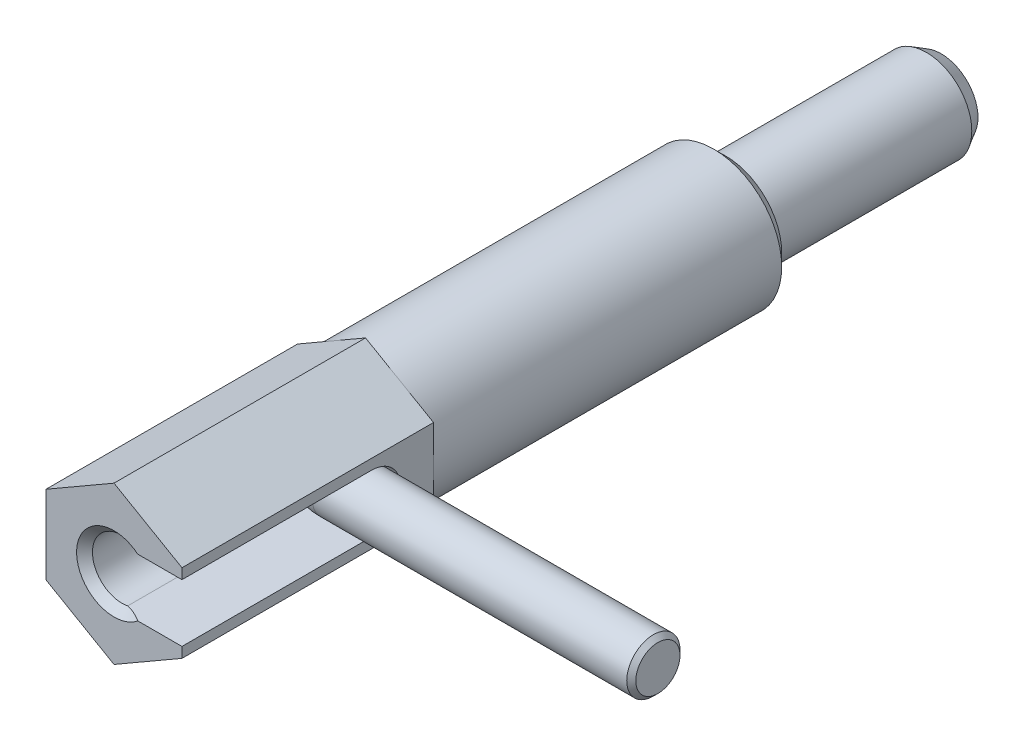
ISO-10303-21;
HEADER;
FILE_DESCRIPTION(('STEP AP214'),'2;1');
FILE_NAME('part.step','',(''),(''),'','','');
FILE_SCHEMA(('AUTOMOTIVE_DESIGN { 1 0 10303 214 1 1 1 1 }'));
ENDSEC;
DATA;
#1=APPLICATION_CONTEXT('core data for automotive mechanical design processes');
#2=APPLICATION_PROTOCOL_DEFINITION('international standard','automotive_design',2000,#1);
#3=PRODUCT_CONTEXT('',#1,'mechanical');
#4=PRODUCT('Part','Part','',(#3));
#5=PRODUCT_RELATED_PRODUCT_CATEGORY('part','',(#4));
#6=PRODUCT_DEFINITION_FORMATION('','',#4);
#7=PRODUCT_DEFINITION_CONTEXT('part definition',#1,'design');
#8=PRODUCT_DEFINITION('design','',#6,#7);
#9=PRODUCT_DEFINITION_SHAPE('','',#8);
#10=(LENGTH_UNIT() NAMED_UNIT(*) SI_UNIT(.MILLI.,.METRE.));
#11=(NAMED_UNIT(*) PLANE_ANGLE_UNIT() SI_UNIT($,.RADIAN.));
#12=(NAMED_UNIT(*) SI_UNIT($,.STERADIAN.) SOLID_ANGLE_UNIT());
#13=UNCERTAINTY_MEASURE_WITH_UNIT(LENGTH_MEASURE(1.E-05),#10,'distance_accuracy_value','');
#14=(GEOMETRIC_REPRESENTATION_CONTEXT(3) GLOBAL_UNCERTAINTY_ASSIGNED_CONTEXT((#13)) GLOBAL_UNIT_ASSIGNED_CONTEXT((#10,
#11,#12)) REPRESENTATION_CONTEXT('',''));
#15=CARTESIAN_POINT('',(0.,0.,0.));
#16=DIRECTION('',(0.,0.,1.));
#17=DIRECTION('',(1.,0.,0.));
#18=AXIS2_PLACEMENT_3D('',#15,#16,#17);
#19=CARTESIAN_POINT('',(0.,0.,-3.5E-12));
#20=DIRECTION('',(0.,0.,1.));
#21=DIRECTION('',(1.,0.,0.));
#22=AXIS2_PLACEMENT_3D('',#19,#20,#21);
#23=CYLINDRICAL_SURFACE('',#22,4.);
#24=CARTESIAN_POINT('',(1.16964692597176E-13,0.,33.5000000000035));
#25=DIRECTION('',(0.,0.,1.));
#26=DIRECTION('',(0.,1.,0.));
#27=AXIS2_PLACEMENT_3D('',#24,#25,#26);
#28=CIRCLE('',#27,4.);
#29=CARTESIAN_POINT('',(1.16964692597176E-13,4.,33.5000000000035));
#30=VERTEX_POINT('',#29);
#31=EDGE_CURVE('E114',#30,#30,#28,.T.);
#32=ORIENTED_EDGE('',*,*,#31,.T.);
#33=EDGE_LOOP('',(#32));
#34=FACE_BOUND('',#33,.T.);
#35=CARTESIAN_POINT('',(1.11029170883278E-13,0.,31.8));
#36=DIRECTION('',(0.,0.,-1.));
#37=DIRECTION('',(-1.,0.,0.));
#38=AXIS2_PLACEMENT_3D('',#35,#36,#37);
#39=CIRCLE('',#38,4.);
#40=CARTESIAN_POINT('',(-3.99999999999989,0.,31.8));
#41=VERTEX_POINT('',#40);
#42=EDGE_CURVE('E132',#41,#41,#39,.T.);
#43=ORIENTED_EDGE('',*,*,#42,.T.);
#44=EDGE_LOOP('',(#43));
#45=FACE_BOUND('',#44,.T.);
#46=ADVANCED_FACE('F14',(#34,#45),#23,.F.);
#47=CARTESIAN_POINT('',(1.18743807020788E-13,0.,34.0095583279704));
#48=DIRECTION('',(0.,0.,1.));
#49=DIRECTION('',(1.,0.,0.));
#50=AXIS2_PLACEMENT_3D('',#47,#48,#49);
#51=CYLINDRICAL_SURFACE('',#50,2.6);
#52=CARTESIAN_POINT('',(2.60000000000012,0.,34.6861902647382));
#53=CARTESIAN_POINT('',(2.59999836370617,-0.11859070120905,34.6861926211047));
#54=CARTESIAN_POINT('',(2.5918521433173,-0.237201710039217,34.6911356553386));
#55=CARTESIAN_POINT('',(2.55962961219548,-0.471484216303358,34.7105280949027));
#56=CARTESIAN_POINT('',(2.53554281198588,-0.587153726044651,34.7249837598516));
#57=CARTESIAN_POINT('',(2.47027992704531,-0.820611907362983,34.7639270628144));
#58=CARTESIAN_POINT('',(2.42804189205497,-0.937998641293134,34.7890366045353));
#59=CARTESIAN_POINT('',(2.32832586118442,-1.16365921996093,34.8487715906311));
#60=CARTESIAN_POINT('',(2.27083550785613,-1.27192558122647,34.8834047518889));
#61=CARTESIAN_POINT('',(2.17334144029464,-1.428529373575,34.9441244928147));
#62=CARTESIAN_POINT('',(2.13779832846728,-1.48114058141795,34.9665908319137));
#63=CARTESIAN_POINT('',(2.06371245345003,-1.5827306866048,35.0146616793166));
#64=CARTESIAN_POINT('',(2.02516913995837,-1.63170891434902,35.0402667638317));
#65=CARTESIAN_POINT('',(1.9457736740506,-1.7256134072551,35.0949706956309));
#66=CARTESIAN_POINT('',(1.90492326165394,-1.77054266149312,35.1240669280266));
#67=CARTESIAN_POINT('',(1.82175713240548,-1.85600573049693,35.1862777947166));
#68=CARTESIAN_POINT('',(1.77944210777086,-1.89654158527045,35.2193905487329));
#69=CARTESIAN_POINT('',(1.68027464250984,-1.98555932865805,35.3020822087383));
#70=CARTESIAN_POINT('',(1.62325876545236,-2.03221287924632,35.3534785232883));
#71=CARTESIAN_POINT('',(1.5122497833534,-2.11611042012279,35.4661681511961));
#72=CARTESIAN_POINT('',(1.45825009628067,-2.1533755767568,35.5274386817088));
#73=CARTESIAN_POINT('',(1.36719417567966,-2.21205351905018,35.6487884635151));
#74=CARTESIAN_POINT('',(1.32883982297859,-2.23511434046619,35.7070795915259));
#75=CARTESIAN_POINT('',(1.26034218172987,-2.27444622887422,35.830378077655));
#76=CARTESIAN_POINT('',(1.23019084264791,-2.29072396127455,35.8953787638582));
#77=CARTESIAN_POINT('',(1.18003972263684,-2.31696403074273,36.0303883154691));
#78=CARTESIAN_POINT('',(1.16004319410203,-2.32692434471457,36.1003987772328));
#79=CARTESIAN_POINT('',(1.13050716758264,-2.34141358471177,36.2431439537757));
#80=CARTESIAN_POINT('',(1.12098115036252,-2.34593550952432,36.3158820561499));
#81=CARTESIAN_POINT('',(1.1094520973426,-2.35142386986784,36.4916801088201));
#82=CARTESIAN_POINT('',(1.11205867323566,-2.35020848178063,36.595088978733));
#83=CARTESIAN_POINT('',(1.13163580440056,-2.340829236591,36.8002464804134));
#84=CARTESIAN_POINT('',(1.14864850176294,-2.33264499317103,36.9019893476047));
#85=CARTESIAN_POINT('',(1.1892944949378,-2.31214164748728,37.0846559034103));
#86=CARTESIAN_POINT('',(1.21123176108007,-2.30080592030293,37.1660876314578));
#87=CARTESIAN_POINT('',(1.26068524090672,-2.27408493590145,37.3265939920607));
#88=CARTESIAN_POINT('',(1.28820508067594,-2.25869704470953,37.4056670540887));
#89=CARTESIAN_POINT('',(1.34758589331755,-2.22378061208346,37.5613271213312));
#90=CARTESIAN_POINT('',(1.37945207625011,-2.20424708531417,37.6379110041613));
#91=CARTESIAN_POINT('',(1.44649240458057,-2.16084601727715,37.7883655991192));
#92=CARTESIAN_POINT('',(1.48166783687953,-2.13697678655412,37.8622352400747));
#93=CARTESIAN_POINT('',(1.59534633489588,-2.05522086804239,38.0884979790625));
#94=CARTESIAN_POINT('',(1.67815440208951,-1.9892299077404,38.2359353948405));
#95=CARTESIAN_POINT('',(1.84718142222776,-1.8333356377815,38.5151662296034));
#96=CARTESIAN_POINT('',(1.93339292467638,-1.74348233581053,38.6469915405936));
#97=CARTESIAN_POINT('',(2.07851861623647,-1.56497420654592,38.8576956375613));
#98=CARTESIAN_POINT('',(2.13846971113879,-1.48266464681,38.9412136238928));
#99=CARTESIAN_POINT('',(2.2523786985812,-1.30309383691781,39.0953519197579));
#100=CARTESIAN_POINT('',(2.30634395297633,-1.20585131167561,39.1659881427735));
#101=CARTESIAN_POINT('',(2.39511306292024,-1.01602783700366,39.2797845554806));
#102=CARTESIAN_POINT('',(2.43161622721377,-0.925849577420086,39.3256072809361));
#103=CARTESIAN_POINT('',(2.495338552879,-0.73701440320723,39.4046440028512));
#104=CARTESIAN_POINT('',(2.52256246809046,-0.638361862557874,39.4378644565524));
#105=CARTESIAN_POINT('',(2.56562834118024,-0.434165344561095,39.490070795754));
#106=CARTESIAN_POINT('',(2.58139218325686,-0.32857932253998,39.5089590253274));
#107=CARTESIAN_POINT('',(2.59968384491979,-0.11464885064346,39.5308542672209));
#108=CARTESIAN_POINT('',(2.60221875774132,-0.00630591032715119,39.5338697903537));
#109=CARTESIAN_POINT('',(2.59430382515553,0.196821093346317,39.524412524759));
#110=CARTESIAN_POINT('',(2.58529336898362,0.291749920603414,39.5136567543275));
#111=CARTESIAN_POINT('',(2.55742777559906,0.477937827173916,39.4801306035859));
#112=CARTESIAN_POINT('',(2.53857254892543,0.569196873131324,39.457360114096));
#113=CARTESIAN_POINT('',(2.4920202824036,0.747290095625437,39.400475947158));
#114=CARTESIAN_POINT('',(2.46419348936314,0.834036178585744,39.3661954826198));
#115=CARTESIAN_POINT('',(2.40155846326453,1.00020970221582,39.2878016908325));
#116=CARTESIAN_POINT('',(2.36674688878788,1.0796336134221,39.2436836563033));
#117=CARTESIAN_POINT('',(2.2749098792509,1.26482392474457,39.1249742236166));
#118=CARTESIAN_POINT('',(2.2149843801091,1.3661315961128,39.0456513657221));
#119=CARTESIAN_POINT('',(2.08930404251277,1.55159036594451,38.8728447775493));
#120=CARTESIAN_POINT('',(2.02353678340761,1.63570358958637,38.7793305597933));
#121=CARTESIAN_POINT('',(1.86736001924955,1.81424473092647,38.5463793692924));
#122=CARTESIAN_POINT('',(1.776335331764,1.90208566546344,38.4022822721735));
#123=CARTESIAN_POINT('',(1.64464957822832,2.01456618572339,38.1741342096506));
#124=CARTESIAN_POINT('',(1.60150935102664,2.04887858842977,38.0959737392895));
#125=CARTESIAN_POINT('',(1.51790375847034,2.1115615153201,37.9359094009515));
#126=CARTESIAN_POINT('',(1.47743764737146,2.13993370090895,37.8540065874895));
#127=CARTESIAN_POINT('',(1.4071397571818,2.18664444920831,37.7014135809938));
#128=CARTESIAN_POINT('',(1.37668772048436,2.20587003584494,37.6312767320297));
#129=CARTESIAN_POINT('',(1.31918055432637,2.24073476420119,37.4887591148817));
#130=CARTESIAN_POINT('',(1.29212470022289,2.2563746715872,37.4163788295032));
#131=CARTESIAN_POINT('',(1.24238283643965,2.28413978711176,37.2696569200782));
#132=CARTESIAN_POINT('',(1.2196864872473,2.29627334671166,37.1953204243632));
#133=CARTESIAN_POINT('',(1.17974285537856,2.31704854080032,37.0447518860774));
#134=CARTESIAN_POINT('',(1.16249180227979,2.32569259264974,36.9685211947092));
#135=CARTESIAN_POINT('',(1.13306231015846,2.34018742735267,36.8044219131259));
#136=CARTESIAN_POINT('',(1.12183442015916,2.34552922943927,36.7163283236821));
#137=CARTESIAN_POINT('',(1.11078987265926,2.35078727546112,36.5392461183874));
#138=CARTESIAN_POINT('',(1.11095608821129,2.35071166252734,36.4502590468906));
#139=CARTESIAN_POINT('',(1.12423551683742,2.344383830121,36.287851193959));
#140=CARTESIAN_POINT('',(1.13525622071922,2.33912978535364,36.214234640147));
#141=CARTESIAN_POINT('',(1.16815830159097,2.32287424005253,36.0701493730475));
#142=CARTESIAN_POINT('',(1.19002528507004,2.3118803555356,35.9996766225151));
#143=CARTESIAN_POINT('',(1.24408054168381,2.28323974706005,35.8640787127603));
#144=CARTESIAN_POINT('',(1.27628983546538,2.26557946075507,35.798964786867));
#145=CARTESIAN_POINT('',(1.34872427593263,2.22321780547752,35.6758544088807));
#146=CARTESIAN_POINT('',(1.3889596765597,2.19850741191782,35.6178672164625));
#147=CARTESIAN_POINT('',(1.4868693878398,2.13390716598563,35.4934989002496));
#148=CARTESIAN_POINT('',(1.54619586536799,2.09169073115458,35.4296500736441));
#149=CARTESIAN_POINT('',(1.6671974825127,1.99659782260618,35.3129924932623));
#150=CARTESIAN_POINT('',(1.72887796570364,1.94369576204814,35.2602108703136));
#151=CARTESIAN_POINT('',(1.83040771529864,1.84737493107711,35.1795721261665));
#152=CARTESIAN_POINT('',(1.87078201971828,1.80653674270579,35.1492181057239));
#153=CARTESIAN_POINT('',(1.94984374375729,1.72090124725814,35.0920551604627));
#154=CARTESIAN_POINT('',(1.9885306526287,1.67610275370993,35.0652473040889));
#155=CARTESIAN_POINT('',(2.06350840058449,1.58288167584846,35.0147602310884));
#156=CARTESIAN_POINT('',(2.09979890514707,1.53445858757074,34.9910814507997));
#157=CARTESIAN_POINT('',(2.16945113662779,1.43429604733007,34.9465389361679));
#158=CARTESIAN_POINT('',(2.20281177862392,1.38255537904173,34.9256762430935));
#159=CARTESIAN_POINT('',(2.26653714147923,1.27543648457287,34.8863341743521));
#160=CARTESIAN_POINT('',(2.29686006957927,1.22002140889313,34.8678871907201));
#161=CARTESIAN_POINT('',(2.35366464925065,1.10648237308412,34.8335780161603));
#162=CARTESIAN_POINT('',(2.38014481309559,1.04835737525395,34.8177168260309));
#163=CARTESIAN_POINT('',(2.45324955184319,0.870582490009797,34.7740166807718));
#164=CARTESIAN_POINT('',(2.49367190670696,0.747310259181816,34.7499808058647));
#165=CARTESIAN_POINT('',(2.5495622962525,0.520150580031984,34.7165869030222));
#166=CARTESIAN_POINT('',(2.56841689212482,0.417360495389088,34.7052474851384));
#167=CARTESIAN_POINT('',(2.59363425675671,0.209718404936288,34.6900494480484));
#168=CARTESIAN_POINT('',(2.60000144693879,0.104867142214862,34.6861881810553));
#169=CARTESIAN_POINT('',(2.60000000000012,0.,34.6861902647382));
#170=B_SPLINE_CURVE_WITH_KNOTS('',3,(#52,#53,#54,#55,#56,#57,#58,#59,#60,#61,#62,#63,#64,#65,
#66,#67,#68,#69,#70,#71,#72,#73,#74,#75,#76,#77,#78,#79,#80,#81,#82,#83,#84,#85,#86,#87,#88,#89,
#90,#91,#92,#93,#94,#95,#96,#97,#98,#99,#100,#101,#102,#103,#104,#105,#106,#107,#108,#109,#110,
#111,#112,#113,#114,#115,#116,#117,#118,#119,#120,#121,#122,#123,#124,#125,#126,#127,#128,#129,
#130,#131,#132,#133,#134,#135,#136,#137,#138,#139,#140,#141,#142,#143,#144,#145,#146,#147,#148,
#149,#150,#151,#152,#153,#154,#155,#156,#157,#158,#159,#160,#161,#162,#163,#164,#165,#166,#167,
#168,#169),.UNSPECIFIED.,.T.,.F.,(4,2,2,2,2,2,2,2,2,2,2,2,2,2,2,2,2,2,2,2,2,2,2,2,2,2,2,2,2,2,2,
2,2,2,2,2,2,2,2,2,2,2,2,2,2,2,2,2,2,2,2,2,2,2,2,2,2,2,4),(0.,0.355435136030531,
0.711104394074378,1.09124940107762,1.47170334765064,1.67355536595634,1.87544449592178,
2.0771833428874,2.27882811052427,2.54740190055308,2.81536465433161,3.0348713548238,
3.25416184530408,3.47352252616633,3.69316530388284,4.00176771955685,4.31127601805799,
4.56621715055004,4.82132440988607,5.07674020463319,5.33225573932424,5.87465198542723,
6.41592039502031,6.80969675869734,7.20298332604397,7.52430858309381,7.84546897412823,
8.1687984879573,8.49195461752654,8.77847745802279,9.0650029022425,9.35587362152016,
9.64688382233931,10.0703152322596,10.4946695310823,11.0666115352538,11.35333761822,
11.6399834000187,11.8763468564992,12.1126597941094,12.3484051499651,12.5839869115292,
12.850183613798,13.1159801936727,13.3389071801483,13.561539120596,13.7846264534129,
14.0080006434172,14.2969418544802,14.5865833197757,14.7812259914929,14.9759271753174,
15.1706554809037,15.3654555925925,15.5626464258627,15.7599133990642,16.1536419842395,
16.4680567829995,16.7823602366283),.UNSPECIFIED.);
#171=CARTESIAN_POINT('',(1.13334254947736,2.33998603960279,36.2366070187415));
#172=VERTEX_POINT('',#171);
#173=CARTESIAN_POINT('',(1.13334254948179,-2.33998603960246,36.2366070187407));
#174=VERTEX_POINT('',#173);
#175=EDGE_CURVE('E197',#172,#174,#170,.T.);
#176=ORIENTED_EDGE('',*,*,#175,.F.);
#177=CARTESIAN_POINT('',(0.507444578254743,2.55,37.25));
#178=CARTESIAN_POINT('',(0.507261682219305,2.55001860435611,37.2125611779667));
#179=CARTESIAN_POINT('',(0.511608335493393,2.54917685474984,37.1755454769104));
#180=CARTESIAN_POINT('',(0.526976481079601,2.54605040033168,37.1038614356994));
#181=CARTESIAN_POINT('',(0.537834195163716,2.54380104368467,37.0691579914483));
#182=CARTESIAN_POINT('',(0.564790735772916,2.53795236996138,36.9998107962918));
#183=CARTESIAN_POINT('',(0.581153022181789,2.53428341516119,36.9652831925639));
#184=CARTESIAN_POINT('',(0.616947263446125,2.52581102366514,36.8979717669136));
#185=CARTESIAN_POINT('',(0.636384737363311,2.5210055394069,36.8651912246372));
#186=CARTESIAN_POINT('',(0.698250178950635,2.50484792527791,36.7676502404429));
#187=CARTESIAN_POINT('',(0.743586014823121,2.49188067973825,36.705041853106));
#188=CARTESIAN_POINT('',(0.858840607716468,2.4551151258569,36.5547665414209));
#189=CARTESIAN_POINT('',(0.930397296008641,2.42908354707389,36.4689667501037));
#190=CARTESIAN_POINT('',(1.07496348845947,2.36867929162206,36.3014461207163));
#191=CARTESIAN_POINT('',(1.1479749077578,2.33429484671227,36.2197312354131));
#192=CARTESIAN_POINT('',(1.29283824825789,2.25726605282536,36.0604559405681));
#193=CARTESIAN_POINT('',(1.36469475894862,2.21468560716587,35.9828689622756));
#194=CARTESIAN_POINT('',(1.50642356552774,2.12082815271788,35.8313684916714));
#195=CARTESIAN_POINT('',(1.57629743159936,2.06955826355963,35.7574520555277));
#196=CARTESIAN_POINT('',(1.74440157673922,1.93226690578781,35.5807207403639));
#197=CARTESIAN_POINT('',(1.84093687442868,1.8410924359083,35.4802028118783));
#198=CARTESIAN_POINT('',(2.02361480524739,1.63816615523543,35.2908885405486));
#199=CARTESIAN_POINT('',(2.10976288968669,1.52642521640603,35.2020860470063));
#200=CARTESIAN_POINT('',(2.24792814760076,1.3111301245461,35.0600498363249));
#201=CARTESIAN_POINT('',(2.30319026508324,1.21194674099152,35.0033793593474));
#202=CARTESIAN_POINT('',(2.40191037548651,1.00210567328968,34.9022793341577));
#203=CARTESIAN_POINT('',(2.44538470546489,0.8914641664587,34.85783284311));
#204=CARTESIAN_POINT('',(2.51209979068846,0.678147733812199,34.7896776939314));
#205=CARTESIAN_POINT('',(2.53740767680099,0.576803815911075,34.7638478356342));
#206=CARTESIAN_POINT('',(2.5757692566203,0.36946341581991,34.7247074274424));
#207=CARTESIAN_POINT('',(2.58882969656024,0.26346952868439,34.7113899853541));
#208=CARTESIAN_POINT('',(2.60174076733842,0.0495453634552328,34.6982247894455));
#209=CARTESIAN_POINT('',(2.60155613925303,-0.0583893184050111,34.6984129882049));
#210=CARTESIAN_POINT('',(2.58790399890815,-0.272523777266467,34.7123339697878));
#211=CARTESIAN_POINT('',(2.57443431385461,-0.378723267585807,34.7260689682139));
#212=CARTESIAN_POINT('',(2.53598503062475,-0.582333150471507,34.7652998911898));
#213=CARTESIAN_POINT('',(2.51146652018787,-0.679924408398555,34.7903247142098));
#214=CARTESIAN_POINT('',(2.45256464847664,-0.868750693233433,34.8504978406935));
#215=CARTESIAN_POINT('',(2.41817751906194,-0.959983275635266,34.885650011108));
#216=CARTESIAN_POINT('',(2.32560199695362,-1.17028313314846,34.980403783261));
#217=CARTESIAN_POINT('',(2.26340854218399,-1.28572674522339,35.0441474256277));
#218=CARTESIAN_POINT('',(2.12701030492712,-1.50070873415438,35.1843449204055));
#219=CARTESIAN_POINT('',(2.05277955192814,-1.60021177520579,35.2608262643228));
#220=CARTESIAN_POINT('',(1.86644538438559,-1.81763641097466,35.4536216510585));
#221=CARTESIAN_POINT('',(1.75054337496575,-1.92858354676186,35.5741522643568));
#222=CARTESIAN_POINT('',(1.5699891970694,-2.0739148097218,35.7641498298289));
#223=CARTESIAN_POINT('',(1.50862360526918,-2.11887764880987,35.8290847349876));
#224=CARTESIAN_POINT('',(1.38438985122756,-2.20205664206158,35.9617591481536));
#225=CARTESIAN_POINT('',(1.32152219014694,-2.24027501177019,36.029497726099));
#226=CARTESIAN_POINT('',(1.17125901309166,-2.32335918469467,36.1936363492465));
#227=CARTESIAN_POINT('',(1.08353591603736,-2.36531455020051,36.2912297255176));
#228=CARTESIAN_POINT('',(0.953703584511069,-2.41922623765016,36.4421166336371));
#229=CARTESIAN_POINT('',(0.910747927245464,-2.4356847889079,36.4931241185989));
#230=CARTESIAN_POINT('',(0.826284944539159,-2.46561267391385,36.5971655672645));
#231=CARTESIAN_POINT('',(0.784776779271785,-2.47908376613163,36.6501983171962));
#232=CARTESIAN_POINT('',(0.7140209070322,-2.50024279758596,36.7468651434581));
#233=CARTESIAN_POINT('',(0.684132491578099,-2.50854917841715,36.7898921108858));
#234=CARTESIAN_POINT('',(0.627870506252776,-2.52321474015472,36.878632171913));
#235=CARTESIAN_POINT('',(0.601497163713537,-2.52957379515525,36.9243454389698));
#236=CARTESIAN_POINT('',(0.563261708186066,-2.53830454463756,37.0039408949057));
#237=CARTESIAN_POINT('',(0.549474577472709,-2.54130013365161,37.0368032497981));
#238=CARTESIAN_POINT('',(0.527020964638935,-2.54605254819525,37.1042499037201));
#239=CARTESIAN_POINT('',(0.518325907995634,-2.54781629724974,37.1388233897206));
#240=CARTESIAN_POINT('',(0.511251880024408,-2.54924001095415,37.1864788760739));
#241=CARTESIAN_POINT('',(0.509833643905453,-2.54952367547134,37.199111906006));
#242=CARTESIAN_POINT('',(0.507926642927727,-2.54990413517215,37.2244943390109));
#243=CARTESIAN_POINT('',(0.507441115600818,-2.55000027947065,37.237243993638));
#244=CARTESIAN_POINT('',(0.507444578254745,-2.55,37.25));
#245=B_SPLINE_CURVE_WITH_KNOTS('',3,(#177,#178,#179,#180,#181,#182,#183,#184,#185,#186,#187,
#188,#189,#190,#191,#192,#193,#194,#195,#196,#197,#198,#199,#200,#201,#202,#203,#204,#205,#206,
#207,#208,#209,#210,#211,#212,#213,#214,#215,#216,#217,#218,#219,#220,#221,#222,#223,#224,#225,
#226,#227,#228,#229,#230,#231,#232,#233,#234,#235,#236,#237,#238,#239,#240,#241,#242,#243,#244),
.UNSPECIFIED.,.F.,.F.,(4,2,2,2,2,2,2,2,2,2,2,2,2,2,2,2,2,2,2,2,2,2,2,2,2,2,2,2,2,2,2,2,2,4),(0.,
0.111402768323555,0.220114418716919,0.335022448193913,0.45013909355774,0.684836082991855,
1.02853863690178,1.37272826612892,1.71433569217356,2.05566456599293,2.5535629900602,
3.05119896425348,3.430510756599,3.80929413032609,4.13071445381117,4.45195762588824,
4.77405599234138,5.09620704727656,5.4060068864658,5.7159251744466,6.15090347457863,
6.58683304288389,7.1853707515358,7.48523320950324,7.78499697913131,8.19756295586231,
8.4035550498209,8.60942556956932,8.76845312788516,8.92749096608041,9.03451883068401,
9.14094019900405,9.17905504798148,9.21730196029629),.UNSPECIFIED.);
#246=CARTESIAN_POINT('',(0.507444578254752,2.55,37.25));
#247=VERTEX_POINT('',#246);
#248=EDGE_CURVE('E162',#247,#172,#245,.T.);
#249=ORIENTED_EDGE('',*,*,#248,.F.);
#250=DIRECTION('',(0.,0.,-1.));
#251=VECTOR('',#250,1.);
#252=CARTESIAN_POINT('',(0.507444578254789,2.55,45.6250000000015));
#253=LINE('',#252,#251);
#254=CARTESIAN_POINT('',(0.507444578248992,2.55,53.2999999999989));
#255=VERTEX_POINT('',#254);
#256=EDGE_CURVE('E107',#255,#247,#253,.T.);
#257=ORIENTED_EDGE('',*,*,#256,.F.);
#258=CARTESIAN_POINT('',(1.86096063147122E-13,0.,53.2999999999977));
#259=DIRECTION('',(0.,0.,-1.));
#260=DIRECTION('',(0.,1.,0.));
#261=AXIS2_PLACEMENT_3D('',#258,#259,#260);
#262=CIRCLE('',#261,2.59999999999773);
#263=CARTESIAN_POINT('',(0.507444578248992,-2.55,53.2999999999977));
#264=VERTEX_POINT('',#263);
#265=EDGE_CURVE('E125',#264,#255,#262,.T.);
#266=ORIENTED_EDGE('',*,*,#265,.F.);
#267=DIRECTION('',(0.,0.,1.));
#268=VECTOR('',#267,1.);
#269=CARTESIAN_POINT('',(0.507444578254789,-2.55,45.6250000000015));
#270=LINE('',#269,#268);
#271=CARTESIAN_POINT('',(0.50744457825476,-2.55,37.25));
#272=VERTEX_POINT('',#271);
#273=EDGE_CURVE('E106',#272,#264,#270,.T.);
#274=ORIENTED_EDGE('',*,*,#273,.F.);
#275=EDGE_CURVE('E169',#174,#272,#245,.T.);
#276=ORIENTED_EDGE('',*,*,#275,.F.);
#277=EDGE_LOOP('',(#176,#249,#257,#266,#274,#276));
#278=FACE_BOUND('',#277,.T.);
#279=CARTESIAN_POINT('',(1.18743807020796E-13,0.,34.0095583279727));
#280=DIRECTION('',(0.,0.,1.));
#281=DIRECTION('',(0.,1.,0.));
#282=AXIS2_PLACEMENT_3D('',#279,#280,#281);
#283=CIRCLE('',#282,2.6);
#284=CARTESIAN_POINT('',(1.18743807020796E-13,2.6,34.0095583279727));
#285=VERTEX_POINT('',#284);
#286=EDGE_CURVE('E127',#285,#285,#283,.T.);
#287=ORIENTED_EDGE('',*,*,#286,.F.);
#288=EDGE_LOOP('',(#287));
#289=FACE_BOUND('',#288,.T.);
#290=ADVANCED_FACE('F16',(#278,#289),#51,.F.);
#291=CARTESIAN_POINT('',(1.16964692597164E-13,0.,33.5));
#292=DIRECTION('',(0.,0.,-1.));
#293=DIRECTION('',(-1.,0.,0.));
#294=AXIS2_PLACEMENT_3D('',#291,#292,#293);
#295=CONICAL_SURFACE('',#294,4.,1.22173047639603);
#296=ORIENTED_EDGE('',*,*,#31,.F.);
#297=EDGE_LOOP('',(#296));
#298=FACE_BOUND('',#297,.T.);
#299=ORIENTED_EDGE('',*,*,#286,.T.);
#300=EDGE_LOOP('',(#299));
#301=FACE_BOUND('',#300,.T.);
#302=ADVANCED_FACE('F529',(#298,#301),#295,.F.);
#303=CARTESIAN_POINT('',(1.88540101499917E-13,0.,54.0000000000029));
#304=DIRECTION('',(0.,0.,1.));
#305=DIRECTION('',(1.,0.,0.));
#306=AXIS2_PLACEMENT_3D('',#303,#304,#305);
#307=CONICAL_SURFACE('',#306,3.30000000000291,0.785398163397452);
#308=CARTESIAN_POINT('',(2.09463600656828,2.55,54.0000000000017));
#309=CARTESIAN_POINT('',(2.0331319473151,2.55,53.960972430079));
#310=CARTESIAN_POINT('',(1.97116701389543,2.55,53.9226568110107));
#311=CARTESIAN_POINT('',(1.84617516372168,2.55,53.8477514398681));
#312=CARTESIAN_POINT('',(1.78314788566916,2.55,53.8111622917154));
#313=CARTESIAN_POINT('',(1.65646998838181,2.55,53.7403392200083));
#314=CARTESIAN_POINT('',(1.59282910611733,2.55,53.7060880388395));
#315=CARTESIAN_POINT('',(1.46431098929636,2.55,53.6400119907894));
#316=CARTESIAN_POINT('',(1.39943373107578,2.55,53.6081871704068));
#317=CARTESIAN_POINT('',(1.20229735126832,2.55,53.516806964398));
#318=CARTESIAN_POINT('',(1.06792232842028,2.55,53.4615694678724));
#319=CARTESIAN_POINT('',(0.792468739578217,2.55,53.367155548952));
#320=CARTESIAN_POINT('',(0.651343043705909,2.55,53.3281190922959));
#321=CARTESIAN_POINT('',(0.507444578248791,2.55,53.2999999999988));
#322=B_SPLINE_CURVE_WITH_KNOTS('',3,(#308,#309,#310,#311,#312,#313,#314,#315,#316,#317,#318,
#319,#320,#321),.UNSPECIFIED.,.F.,.F.,(4,2,2,2,2,2,4),(0.,0.218530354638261,0.437136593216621,
0.653899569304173,0.870666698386,1.30554319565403,1.74410221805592),.UNSPECIFIED.);
#323=CARTESIAN_POINT('',(2.0946360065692,2.55,54.0000000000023));
#324=VERTEX_POINT('',#323);
#325=EDGE_CURVE('E92',#324,#255,#322,.T.);
#326=ORIENTED_EDGE('',*,*,#325,.F.);
#327=CARTESIAN_POINT('',(1.88540101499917E-13,0.,54.0000000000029));
#328=DIRECTION('',(0.,0.,1.));
#329=DIRECTION('',(1.,0.,0.));
#330=AXIS2_PLACEMENT_3D('',#327,#328,#329);
#331=CIRCLE('',#330,3.30000000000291);
#332=CARTESIAN_POINT('',(2.094636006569,-2.55,54.0000000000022));
#333=VERTEX_POINT('',#332);
#334=EDGE_CURVE('E85',#333,#324,#331,.F.);
#335=ORIENTED_EDGE('',*,*,#334,.F.);
#336=CARTESIAN_POINT('',(0.507444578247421,-2.55,53.2999999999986));
#337=CARTESIAN_POINT('',(0.604817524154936,-2.55,53.3189846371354));
#338=CARTESIAN_POINT('',(0.701039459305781,-2.55,53.3430503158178));
#339=CARTESIAN_POINT('',(0.890732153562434,-2.55,53.3995835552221));
#340=CARTESIAN_POINT('',(0.984209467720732,-2.55,53.4320289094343));
#341=CARTESIAN_POINT('',(1.16760170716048,-2.55,53.5033383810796));
#342=CARTESIAN_POINT('',(1.25754203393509,-2.55,53.54213861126));
#343=CARTESIAN_POINT('',(1.43501170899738,-2.55,53.6249963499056));
#344=CARTESIAN_POINT('',(1.52253960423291,-2.55,53.6690569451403));
#345=CARTESIAN_POINT('',(1.69157857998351,-2.55,53.7592551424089));
#346=CARTESIAN_POINT('',(1.77318495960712,-2.55,53.8052161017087));
#347=CARTESIAN_POINT('',(1.93500161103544,-2.55,53.9003883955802));
#348=CARTESIAN_POINT('',(2.01520353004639,-2.55,53.9496139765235));
#349=CARTESIAN_POINT('',(2.0946360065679,-2.55,54.0000000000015));
#350=B_SPLINE_CURVE_WITH_KNOTS('',3,(#336,#337,#338,#339,#340,#341,#342,#343,#344,#345,#346,
#347,#348,#349),.UNSPECIFIED.,.F.,.F.,(4,2,2,2,2,2,4),(0.,0.297256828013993,0.593733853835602,
0.887395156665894,1.18122963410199,1.46213770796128,1.74436454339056),.UNSPECIFIED.);
#351=EDGE_CURVE('E89',#264,#333,#350,.T.);
#352=ORIENTED_EDGE('',*,*,#351,.F.);
#353=ORIENTED_EDGE('',*,*,#265,.T.);
#354=EDGE_LOOP('',(#326,#335,#352,#353));
#355=FACE_BOUND('',#354,.T.);
#356=ADVANCED_FACE('F87',(#355),#307,.F.);
#357=CARTESIAN_POINT('',(0.5074445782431,-2.55,37.25));
#358=DIRECTION('',(0.,1.,0.));
#359=DIRECTION('',(0.,0.,1.));
#360=AXIS2_PLACEMENT_3D('',#357,#358,#359);
#361=PLANE('',#360);
#362=DIRECTION('',(0.,0.,1.));
#363=VECTOR('',#362,1.);
#364=CARTESIAN_POINT('',(6.00000000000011,-2.55,31.8));
#365=LINE('',#364,#363);
#366=CARTESIAN_POINT('',(6.00000000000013,-2.55,37.25));
#367=VERTEX_POINT('',#366);
#368=CARTESIAN_POINT('',(6.00000000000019,-2.55,54.));
#369=VERTEX_POINT('',#368);
#370=EDGE_CURVE('E414',#367,#369,#365,.T.);
#371=ORIENTED_EDGE('',*,*,#370,.F.);
#372=DIRECTION('',(1.,0.,0.));
#373=VECTOR('',#372,1.);
#374=CARTESIAN_POINT('',(3.25349705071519,-2.55,37.25));
#375=LINE('',#374,#373);
#376=EDGE_CURVE('E168',#272,#367,#375,.T.);
#377=ORIENTED_EDGE('',*,*,#376,.F.);
#378=ORIENTED_EDGE('',*,*,#273,.T.);
#379=ORIENTED_EDGE('',*,*,#351,.T.);
#380=DIRECTION('',(-1.,0.,0.));
#381=VECTOR('',#380,1.);
#382=CARTESIAN_POINT('',(1.88540101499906E-13,-2.55,54.));
#383=LINE('',#382,#381);
#384=EDGE_CURVE('E98',#369,#333,#383,.T.);
#385=ORIENTED_EDGE('',*,*,#384,.F.);
#386=EDGE_LOOP('',(#371,#377,#378,#379,#385));
#387=FACE_BOUND('',#386,.T.);
#388=ADVANCED_FACE('F102',(#387),#361,.T.);
#389=CARTESIAN_POINT('',(0.507444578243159,2.55,54.0000000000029));
#390=DIRECTION('',(0.,-1.,0.));
#391=DIRECTION('',(0.,0.,-1.));
#392=AXIS2_PLACEMENT_3D('',#389,#390,#391);
#393=PLANE('',#392);
#394=DIRECTION('',(1.,0.,0.));
#395=VECTOR('',#394,1.);
#396=CARTESIAN_POINT('',(1.88540101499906E-13,2.55,54.));
#397=LINE('',#396,#395);
#398=CARTESIAN_POINT('',(6.00000000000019,2.55,54.));
#399=VERTEX_POINT('',#398);
#400=EDGE_CURVE('E97',#324,#399,#397,.T.);
#401=ORIENTED_EDGE('',*,*,#400,.F.);
#402=ORIENTED_EDGE('',*,*,#325,.T.);
#403=ORIENTED_EDGE('',*,*,#256,.T.);
#404=DIRECTION('',(-1.,0.,0.));
#405=VECTOR('',#404,1.);
#406=CARTESIAN_POINT('',(3.25349705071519,2.55,37.25));
#407=LINE('',#406,#405);
#408=CARTESIAN_POINT('',(6.00000000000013,2.55,37.25));
#409=VERTEX_POINT('',#408);
#410=EDGE_CURVE('E117',#409,#247,#407,.T.);
#411=ORIENTED_EDGE('',*,*,#410,.F.);
#412=DIRECTION('',(0.,0.,1.));
#413=VECTOR('',#412,1.);
#414=CARTESIAN_POINT('',(6.00000000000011,2.55,31.8));
#415=LINE('',#414,#413);
#416=EDGE_CURVE('E160',#399,#409,#415,.F.);
#417=ORIENTED_EDGE('',*,*,#416,.F.);
#418=EDGE_LOOP('',(#401,#402,#403,#411,#417));
#419=FACE_BOUND('',#418,.T.);
#420=ADVANCED_FACE('F180',(#419),#393,.T.);
#421=CARTESIAN_POINT('',(0.50699410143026,0.,37.25));
#422=DIRECTION('',(1.,0.,0.));
#423=DIRECTION('',(0.,0.,-1.));
#424=AXIS2_PLACEMENT_3D('',#421,#422,#423);
#425=CYLINDRICAL_SURFACE('',#424,2.55);
#426=CARTESIAN_POINT('',(0.474489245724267,-2.33573320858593,36.22684293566));
#427=CARTESIAN_POINT('',(0.517701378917,-2.33894171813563,36.2341743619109));
#428=CARTESIAN_POINT('',(0.561147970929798,-2.34165234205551,36.2404502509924));
#429=CARTESIAN_POINT('',(0.648451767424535,-2.34599356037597,36.250575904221));
#430=CARTESIAN_POINT('',(0.692309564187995,-2.34762222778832,36.2544213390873));
#431=CARTESIAN_POINT('',(0.780732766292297,-2.34971531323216,36.2593712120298));
#432=CARTESIAN_POINT('',(0.825300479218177,-2.35016601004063,36.2604433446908));
#433=CARTESIAN_POINT('',(0.914355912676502,-2.3497245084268,36.2593977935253));
#434=CARTESIAN_POINT('',(0.958843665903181,-2.34883315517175,36.2572821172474));
#435=CARTESIAN_POINT('',(1.07712623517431,-2.34442285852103,36.24687922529));
#436=CARTESIAN_POINT('',(1.15066198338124,-2.33954715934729,36.235415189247));
#437=CARTESIAN_POINT('',(1.25838641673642,-2.32831349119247,36.210032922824));
#438=CARTESIAN_POINT('',(1.29379532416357,-2.32392844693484,36.2002359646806));
#439=CARTESIAN_POINT('',(1.36352936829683,-2.3137230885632,36.1779279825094));
#440=CARTESIAN_POINT('',(1.3978549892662,-2.3079034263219,36.1654181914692));
#441=CARTESIAN_POINT('',(1.46530143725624,-2.29467700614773,36.137708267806));
#442=CARTESIAN_POINT('',(1.49841509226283,-2.28726217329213,36.1224945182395));
#443=CARTESIAN_POINT('',(1.56298293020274,-2.27077820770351,36.0896532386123));
#444=CARTESIAN_POINT('',(1.59443711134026,-2.26170907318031,36.0720257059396));
#445=CARTESIAN_POINT('',(1.68612234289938,-2.23188273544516,36.0159054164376));
#446=CARTESIAN_POINT('',(1.74359204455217,-2.20852249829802,35.974210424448));
#447=CARTESIAN_POINT('',(1.86287746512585,-2.14865174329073,35.8752868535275));
#448=CARTESIAN_POINT('',(1.92262878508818,-2.11034985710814,35.8166951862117));
#449=CARTESIAN_POINT('',(2.0314122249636,-2.02381714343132,35.6968917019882));
#450=CARTESIAN_POINT('',(2.08042236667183,-1.97556634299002,35.635674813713));
#451=CARTESIAN_POINT('',(2.15500233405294,-1.88735734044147,35.5343874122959));
#452=CARTESIAN_POINT('',(2.18300326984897,-1.84982863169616,35.4939331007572));
#453=CARTESIAN_POINT('',(2.23553104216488,-1.77098528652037,35.4144507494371));
#454=CARTESIAN_POINT('',(2.26005681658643,-1.72966949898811,35.3754231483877));
#455=CARTESIAN_POINT('',(2.30607017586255,-1.64355220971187,35.2994787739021));
#456=CARTESIAN_POINT('',(2.32755749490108,-1.59875040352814,35.2625621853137));
#457=CARTESIAN_POINT('',(2.36784120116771,-1.50595561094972,35.1913532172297));
#458=CARTESIAN_POINT('',(2.38663655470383,-1.45796140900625,35.1570618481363));
#459=CARTESIAN_POINT('',(2.43992103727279,-1.30813306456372,35.0578003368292));
#460=CARTESIAN_POINT('',(2.47065730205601,-1.20171676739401,34.997571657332));
#461=CARTESIAN_POINT('',(2.52335898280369,-0.979626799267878,34.8924673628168));
#462=CARTESIAN_POINT('',(2.54532539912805,-0.863954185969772,34.8475899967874));
#463=CARTESIAN_POINT('',(2.58184425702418,-0.618614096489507,34.7726508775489));
#464=CARTESIAN_POINT('',(2.59584712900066,-0.488523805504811,34.7436911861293));
#465=CARTESIAN_POINT('',(2.61386958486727,-0.224745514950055,34.7064328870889));
#466=CARTESIAN_POINT('',(2.6178901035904,-0.0910578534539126,34.6981323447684));
#467=CARTESIAN_POINT('',(2.61576979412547,0.172558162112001,34.702517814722));
#468=CARTESIAN_POINT('',(2.60987908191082,0.302497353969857,34.7146872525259));
#469=CARTESIAN_POINT('',(2.58868763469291,0.558234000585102,34.7584706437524));
#470=CARTESIAN_POINT('',(2.57338674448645,0.684031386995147,34.7900849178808));
#471=CARTESIAN_POINT('',(2.53362493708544,0.928229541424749,34.8714634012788));
#472=CARTESIAN_POINT('',(2.50915786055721,1.04662527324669,34.9212398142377));
#473=CARTESIAN_POINT('',(2.4652741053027,1.21620056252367,35.0078101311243));
#474=CARTESIAN_POINT('',(2.44943072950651,1.27143737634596,35.0386857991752));
#475=CARTESIAN_POINT('',(2.41516342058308,1.37888530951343,35.1040455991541));
#476=CARTESIAN_POINT('',(2.3967404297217,1.43109752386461,35.1385284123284));
#477=CARTESIAN_POINT('',(2.3565295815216,1.53350584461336,35.2116366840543));
#478=CARTESIAN_POINT('',(2.33466450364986,1.58360986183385,35.2503486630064));
#479=CARTESIAN_POINT('',(2.28755408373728,1.67989697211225,35.3305285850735));
#480=CARTESIAN_POINT('',(2.26230802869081,1.72607923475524,35.3719971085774));
#481=CARTESIAN_POINT('',(2.20796096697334,1.81407218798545,35.456854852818));
#482=CARTESIAN_POINT('',(2.17886596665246,1.85588951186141,35.5002410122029));
#483=CARTESIAN_POINT('',(2.11616287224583,1.93483763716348,35.5879577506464));
#484=CARTESIAN_POINT('',(2.08255767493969,1.97197141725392,35.6322877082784));
#485=CARTESIAN_POINT('',(2.00171787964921,2.04920708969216,35.7307896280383));
#486=CARTESIAN_POINT('',(1.95312660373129,2.08802443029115,35.7848780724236));
#487=CARTESIAN_POINT('',(1.84666319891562,2.1573940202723,35.8890960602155));
#488=CARTESIAN_POINT('',(1.78880870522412,2.18796168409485,35.9392328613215));
#489=CARTESIAN_POINT('',(1.69449653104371,2.22757822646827,36.0085781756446));
#490=CARTESIAN_POINT('',(1.66157063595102,2.23980184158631,36.0308387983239));
#491=CARTESIAN_POINT('',(1.59339962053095,2.26210980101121,36.0727489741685));
#492=CARTESIAN_POINT('',(1.55815462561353,2.2721942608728,36.0923986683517));
#493=CARTESIAN_POINT('',(1.4856479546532,2.29028760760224,36.1286192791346));
#494=CARTESIAN_POINT('',(1.44838805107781,2.29829828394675,36.1451928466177));
#495=CARTESIAN_POINT('',(1.37221718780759,2.31238897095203,36.1749991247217));
#496=CARTESIAN_POINT('',(1.3333063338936,2.31846910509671,36.1882320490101));
#497=CARTESIAN_POINT('',(1.22671026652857,2.33249678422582,36.2192559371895));
#498=CARTESIAN_POINT('',(1.15784473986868,2.3387993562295,36.2338103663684));
#499=CARTESIAN_POINT('',(1.01843180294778,2.34727213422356,36.2535461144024));
#500=CARTESIAN_POINT('',(0.947880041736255,2.34943013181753,36.2586997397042));
#501=CARTESIAN_POINT('',(0.809502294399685,2.35035499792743,36.2608913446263));
#502=CARTESIAN_POINT('',(0.741679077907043,2.34925285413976,36.2582428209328));
#503=CARTESIAN_POINT('',(0.607195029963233,2.34437171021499,36.2467912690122));
#504=CARTESIAN_POINT('',(0.540529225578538,2.34061483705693,36.2380391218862));
#505=CARTESIAN_POINT('',(0.474489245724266,2.33573320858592,36.22684293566));
#506=B_SPLINE_CURVE_WITH_KNOTS('',3,(#426,#427,#428,#429,#430,#431,#432,#433,#434,#435,#436,
#437,#438,#439,#440,#441,#442,#443,#444,#445,#446,#447,#448,#449,#450,#451,#452,#453,#454,#455,
#456,#457,#458,#459,#460,#461,#462,#463,#464,#465,#466,#467,#468,#469,#470,#471,#472,#473,#474,
#475,#476,#477,#478,#479,#480,#481,#482,#483,#484,#485,#486,#487,#488,#489,#490,#491,#492,#493,
#494,#495,#496,#497,#498,#499,#500,#501,#502,#503,#504,#505),.UNSPECIFIED.,.F.,.F.,(4,2,2,2,2,2,
2,2,2,2,2,2,2,2,2,2,2,2,2,2,2,2,2,2,2,2,2,2,2,2,2,2,2,2,2,2,2,2,2,4),(0.,0.131850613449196,
0.263935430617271,0.397552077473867,0.531084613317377,0.753748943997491,0.864631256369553,
0.975463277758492,1.08687012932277,1.19827710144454,1.42136472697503,1.69600255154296,
1.97119718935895,2.15661926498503,2.34209788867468,2.52759272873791,2.71315860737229,
3.08967555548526,3.46614954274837,3.86616759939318,4.2661481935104,4.65618568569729,
5.04622961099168,5.43653610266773,5.63205698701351,5.82750663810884,6.02821690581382,
6.22896956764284,6.42941256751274,6.62972743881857,6.8761550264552,7.12211892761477,
7.24669207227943,7.37125848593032,7.49571704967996,7.62016765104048,7.8312241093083,
8.04290131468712,8.24619064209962,8.44780525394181),.UNSPECIFIED.);
#507=EDGE_CURVE('E9',#174,#172,#506,.T.);
#508=ORIENTED_EDGE('',*,*,#507,.F.);
#509=ORIENTED_EDGE('',*,*,#275,.T.);
#510=ORIENTED_EDGE('',*,*,#376,.T.);
#511=CARTESIAN_POINT('',(6.00000000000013,0.,37.25));
#512=DIRECTION('',(1.,0.,0.));
#513=DIRECTION('',(0.,0.,-1.));
#514=AXIS2_PLACEMENT_3D('',#511,#512,#513);
#515=CIRCLE('',#514,2.55);
#516=EDGE_CURVE('E157',#409,#367,#515,.F.);
#517=ORIENTED_EDGE('',*,*,#516,.F.);
#518=ORIENTED_EDGE('',*,*,#410,.T.);
#519=ORIENTED_EDGE('',*,*,#248,.T.);
#520=EDGE_LOOP('',(#508,#509,#510,#517,#518,#519));
#521=FACE_BOUND('',#520,.T.);
#522=ADVANCED_FACE('F176',(#521),#425,.F.);
#523=CARTESIAN_POINT('',(-5.99999999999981,-7.01134166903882,54.));
#524=DIRECTION('',(0.,0.,1.));
#525=DIRECTION('',(1.,0.,0.));
#526=AXIS2_PLACEMENT_3D('',#523,#524,#525);
#527=PLANE('',#526);
#528=DIRECTION('',(-0.866025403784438,-0.5,0.));
#529=VECTOR('',#528,1.);
#530=CARTESIAN_POINT('',(3.00000000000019,-5.19615242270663,54.));
#531=LINE('',#530,#529);
#532=CARTESIAN_POINT('',(6.00000000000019,-3.46410161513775,54.));
#533=VERTEX_POINT('',#532);
#534=CARTESIAN_POINT('',(1.88540101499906E-13,-6.92820323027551,54.));
#535=VERTEX_POINT('',#534);
#536=EDGE_CURVE('E432',#533,#535,#531,.T.);
#537=ORIENTED_EDGE('',*,*,#536,.F.);
#538=DIRECTION('',(0.,-1.,0.));
#539=VECTOR('',#538,1.);
#540=CARTESIAN_POINT('',(6.00000000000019,0.,54.));
#541=LINE('',#540,#539);
#542=EDGE_CURVE('E112',#369,#533,#541,.T.);
#543=ORIENTED_EDGE('',*,*,#542,.F.);
#544=ORIENTED_EDGE('',*,*,#384,.T.);
#545=ORIENTED_EDGE('',*,*,#334,.T.);
#546=ORIENTED_EDGE('',*,*,#400,.T.);
#547=DIRECTION('',(0.,-1.,0.));
#548=VECTOR('',#547,1.);
#549=CARTESIAN_POINT('',(6.00000000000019,0.,54.));
#550=LINE('',#549,#548);
#551=CARTESIAN_POINT('',(6.00000000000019,3.46410161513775,54.));
#552=VERTEX_POINT('',#551);
#553=EDGE_CURVE('E412',#552,#399,#550,.T.);
#554=ORIENTED_EDGE('',*,*,#553,.F.);
#555=DIRECTION('',(0.866025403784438,-0.5,0.));
#556=VECTOR('',#555,1.);
#557=CARTESIAN_POINT('',(3.00000000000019,5.19615242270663,54.));
#558=LINE('',#557,#556);
#559=CARTESIAN_POINT('',(1.88540101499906E-13,6.92820323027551,54.));
#560=VERTEX_POINT('',#559);
#561=EDGE_CURVE('E244',#560,#552,#558,.T.);
#562=ORIENTED_EDGE('',*,*,#561,.F.);
#563=DIRECTION('',(0.866025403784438,0.5,0.));
#564=VECTOR('',#563,1.);
#565=CARTESIAN_POINT('',(-2.99999999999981,5.19615242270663,54.));
#566=LINE('',#565,#564);
#567=CARTESIAN_POINT('',(-5.99999999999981,3.46410161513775,54.));
#568=VERTEX_POINT('',#567);
#569=EDGE_CURVE('E241',#568,#560,#566,.T.);
#570=ORIENTED_EDGE('',*,*,#569,.F.);
#571=DIRECTION('',(0.,1.,0.));
#572=VECTOR('',#571,1.);
#573=CARTESIAN_POINT('',(-5.99999999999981,0.,54.));
#574=LINE('',#573,#572);
#575=CARTESIAN_POINT('',(-5.99999999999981,-3.46410161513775,54.));
#576=VERTEX_POINT('',#575);
#577=EDGE_CURVE('E248',#576,#568,#574,.T.);
#578=ORIENTED_EDGE('',*,*,#577,.F.);
#579=DIRECTION('',(-0.866025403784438,0.5,0.));
#580=VECTOR('',#579,1.);
#581=CARTESIAN_POINT('',(-2.99999999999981,-5.19615242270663,54.));
#582=LINE('',#581,#580);
#583=EDGE_CURVE('E255',#535,#576,#582,.T.);
#584=ORIENTED_EDGE('',*,*,#583,.F.);
#585=EDGE_LOOP('',(#537,#543,#544,#545,#546,#554,#562,#570,#578,#584));
#586=FACE_BOUND('',#585,.T.);
#587=ADVANCED_FACE('F110',(#586),#527,.T.);
#588=CARTESIAN_POINT('',(6.00000000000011,-3.46410161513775,31.8));
#589=DIRECTION('',(1.,0.,0.));
#590=DIRECTION('',(0.,1.,0.));
#591=AXIS2_PLACEMENT_3D('',#588,#589,#590);
#592=PLANE('',#591);
#593=ORIENTED_EDGE('',*,*,#416,.T.);
#594=ORIENTED_EDGE('',*,*,#516,.T.);
#595=ORIENTED_EDGE('',*,*,#370,.T.);
#596=ORIENTED_EDGE('',*,*,#542,.T.);
#597=DIRECTION('',(0.,0.,1.));
#598=VECTOR('',#597,1.);
#599=CARTESIAN_POINT('',(6.00000000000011,-3.46410161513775,31.8));
#600=LINE('',#599,#598);
#601=CARTESIAN_POINT('',(6.00000000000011,-3.46410161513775,31.8));
#602=VERTEX_POINT('',#601);
#603=EDGE_CURVE('E431',#602,#533,#600,.T.);
#604=ORIENTED_EDGE('',*,*,#603,.F.);
#605=DIRECTION('',(0.,1.,0.));
#606=VECTOR('',#605,1.);
#607=CARTESIAN_POINT('',(6.00000000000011,-5.19615242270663,31.8));
#608=LINE('',#607,#606);
#609=CARTESIAN_POINT('',(6.00000000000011,0.,31.8));
#610=VERTEX_POINT('',#609);
#611=EDGE_CURVE('E435',#610,#602,#608,.F.);
#612=ORIENTED_EDGE('',*,*,#611,.F.);
#613=DIRECTION('',(0.,1.,0.));
#614=VECTOR('',#613,1.);
#615=CARTESIAN_POINT('',(6.00000000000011,0.,31.8));
#616=LINE('',#615,#614);
#617=CARTESIAN_POINT('',(6.00000000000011,3.46410161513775,31.8));
#618=VERTEX_POINT('',#617);
#619=EDGE_CURVE('E159',#618,#610,#616,.F.);
#620=ORIENTED_EDGE('',*,*,#619,.F.);
#621=DIRECTION('',(0.,0.,1.));
#622=VECTOR('',#621,1.);
#623=CARTESIAN_POINT('',(6.00000000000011,3.46410161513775,31.8));
#624=LINE('',#623,#622);
#625=EDGE_CURVE('E421',#552,#618,#624,.F.);
#626=ORIENTED_EDGE('',*,*,#625,.F.);
#627=ORIENTED_EDGE('',*,*,#553,.T.);
#628=EDGE_LOOP('',(#593,#594,#595,#596,#604,#612,#620,#626,#627));
#629=FACE_BOUND('',#628,.T.);
#630=ADVANCED_FACE('F209',(#629),#592,.T.);
#631=CARTESIAN_POINT('',(4.98562010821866,4.9265,0.));
#632=DIRECTION('',(0.,0.,-1.));
#633=DIRECTION('',(0.,-1.,0.));
#634=AXIS2_PLACEMENT_3D('',#631,#632,#633);
#635=PLANE('',#634);
#636=CARTESIAN_POINT('',(0.,0.,0.));
#637=DIRECTION('',(0.,0.,-1.));
#638=DIRECTION('',(-1.,0.,0.));
#639=AXIS2_PLACEMENT_3D('',#636,#637,#638);
#640=CIRCLE('',#639,4.);
#641=CARTESIAN_POINT('',(-4.,0.,0.));
#642=VERTEX_POINT('',#641);
#643=EDGE_CURVE('E29',#642,#642,#640,.T.);
#644=ORIENTED_EDGE('',*,*,#643,.F.);
#645=EDGE_LOOP('',(#644));
#646=FACE_BOUND('',#645,.T.);
#647=CARTESIAN_POINT('',(0.,0.,0.));
#648=DIRECTION('',(0.,0.,1.));
#649=DIRECTION('',(1.,0.,0.));
#650=AXIS2_PLACEMENT_3D('',#647,#648,#649);
#651=CIRCLE('',#650,4.9265);
#652=CARTESIAN_POINT('',(4.9265,0.,0.));
#653=VERTEX_POINT('',#652);
#654=EDGE_CURVE('E153',#653,#653,#651,.T.);
#655=ORIENTED_EDGE('',*,*,#654,.F.);
#656=EDGE_LOOP('',(#655));
#657=FACE_BOUND('',#656,.T.);
#658=ADVANCED_FACE('F205',(#646,#657),#635,.T.);
#659=CARTESIAN_POINT('',(6.00000000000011,-0.0311721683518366,31.8));
#660=DIRECTION('',(0.,0.,-1.));
#661=DIRECTION('',(-1.,0.,0.));
#662=AXIS2_PLACEMENT_3D('',#659,#660,#661);
#663=PLANE('',#662);
#664=DIRECTION('',(-0.866025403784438,0.5,0.));
#665=VECTOR('',#664,1.);
#666=CARTESIAN_POINT('',(3.00000000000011,5.19615242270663,31.8));
#667=LINE('',#666,#665);
#668=CARTESIAN_POINT('',(3.00137005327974,5.19536130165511,31.8));
#669=VERTEX_POINT('',#668);
#670=EDGE_CURVE('E809',#618,#669,#667,.T.);
#671=ORIENTED_EDGE('',*,*,#670,.F.);
#672=ORIENTED_EDGE('',*,*,#619,.T.);
#673=CARTESIAN_POINT('',(1.11029170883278E-13,0.,31.8));
#674=DIRECTION('',(0.,0.,1.));
#675=DIRECTION('',(1.,0.,0.));
#676=AXIS2_PLACEMENT_3D('',#673,#674,#675);
#677=CIRCLE('',#676,6.);
#678=EDGE_CURVE('E149',#669,#610,#677,.F.);
#679=ORIENTED_EDGE('',*,*,#678,.F.);
#680=EDGE_LOOP('',(#671,#672,#679));
#681=FACE_BOUND('',#680,.T.);
#682=ADVANCED_FACE('F208',(#681),#663,.T.);
#683=CARTESIAN_POINT('',(6.00000000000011,-5.22653360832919,31.8));
#684=DIRECTION('',(0.,0.,-1.));
#685=DIRECTION('',(-1.,0.,0.));
#686=AXIS2_PLACEMENT_3D('',#683,#684,#685);
#687=PLANE('',#686);
#688=ORIENTED_EDGE('',*,*,#611,.T.);
#689=DIRECTION('',(0.866025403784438,0.5,0.));
#690=VECTOR('',#689,1.);
#691=CARTESIAN_POINT('',(3.00000000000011,-5.19615242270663,31.8));
#692=LINE('',#691,#690);
#693=CARTESIAN_POINT('',(3.00136997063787,-5.19536134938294,31.8));
#694=VERTEX_POINT('',#693);
#695=EDGE_CURVE('E43',#694,#602,#692,.T.);
#696=ORIENTED_EDGE('',*,*,#695,.F.);
#697=CARTESIAN_POINT('',(1.11029170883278E-13,0.,31.8));
#698=DIRECTION('',(0.,0.,1.));
#699=DIRECTION('',(1.,0.,0.));
#700=AXIS2_PLACEMENT_3D('',#697,#698,#699);
#701=CIRCLE('',#700,6.);
#702=EDGE_CURVE('E146',#610,#694,#701,.F.);
#703=ORIENTED_EDGE('',*,*,#702,.F.);
#704=EDGE_LOOP('',(#688,#696,#703));
#705=FACE_BOUND('',#704,.T.);
#706=ADVANCED_FACE('F587',(#705),#687,.T.);
#707=CARTESIAN_POINT('',(1.11029170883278E-13,-6.92820323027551,31.8));
#708=DIRECTION('',(0.5,-0.866025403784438,0.));
#709=DIRECTION('',(0.866025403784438,0.5,0.));
#710=AXIS2_PLACEMENT_3D('',#707,#708,#709);
#711=PLANE('',#710);
#712=ORIENTED_EDGE('',*,*,#695,.T.);
#713=ORIENTED_EDGE('',*,*,#603,.T.);
#714=ORIENTED_EDGE('',*,*,#536,.T.);
#715=DIRECTION('',(0.,0.,1.));
#716=VECTOR('',#715,1.);
#717=CARTESIAN_POINT('',(1.11029170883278E-13,-6.92820323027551,31.8));
#718=LINE('',#717,#716);
#719=CARTESIAN_POINT('',(1.11029170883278E-13,-6.92820323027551,31.8));
#720=VERTEX_POINT('',#719);
#721=EDGE_CURVE('E254',#720,#535,#718,.T.);
#722=ORIENTED_EDGE('',*,*,#721,.F.);
#723=CARTESIAN_POINT('',(3.00000000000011,-5.19615242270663,31.8));
#724=CARTESIAN_POINT('',(2.87500000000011,-5.26832120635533,31.8));
#725=CARTESIAN_POINT('',(2.75000000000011,-5.34048999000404,31.8));
#726=CARTESIAN_POINT('',(2.50000000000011,-5.48482755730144,31.8));
#727=CARTESIAN_POINT('',(2.37500000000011,-5.55699634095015,31.8));
#728=CARTESIAN_POINT('',(2.12500000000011,-5.70133390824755,31.8));
#729=CARTESIAN_POINT('',(2.00000000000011,-5.77350269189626,31.8));
#730=CARTESIAN_POINT('',(1.75000000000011,-5.91784025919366,31.8));
#731=CARTESIAN_POINT('',(1.62500000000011,-5.99000904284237,31.8));
#732=CARTESIAN_POINT('',(1.37500000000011,-6.13434661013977,31.8));
#733=CARTESIAN_POINT('',(1.25000000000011,-6.20651539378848,31.8));
#734=CARTESIAN_POINT('',(1.00000000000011,-6.35085296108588,31.8));
#735=CARTESIAN_POINT('',(0.87500000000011,-6.42302174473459,31.8));
#736=CARTESIAN_POINT('',(0.62500000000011,-6.56735931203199,31.8));
#737=CARTESIAN_POINT('',(0.50000000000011,-6.6395280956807,31.8));
#738=CARTESIAN_POINT('',(0.25000000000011,-6.7838656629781,31.8));
#739=CARTESIAN_POINT('',(0.12500000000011,-6.85603444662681,31.8));
#740=CARTESIAN_POINT('',(1.10154940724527E-13,-6.92820323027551,31.8));
#741=B_SPLINE_CURVE_WITH_KNOTS('',3,(#723,#724,#725,#726,#727,#728,#729,#730,#731,#732,#733,
#734,#735,#736,#737,#738,#739,#740),.UNSPECIFIED.,.F.,.F.,(4,2,2,2,2,2,2,2,4),(0.,
0.43301270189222,0.866025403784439,1.29903810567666,1.73205080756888,2.1650635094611,
2.59807621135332,3.03108891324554,3.46410161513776),.UNSPECIFIED.);
#742=CARTESIAN_POINT('',(2.99863307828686,-5.19694149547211,31.8));
#743=VERTEX_POINT('',#742);
#744=EDGE_CURVE('E258',#743,#720,#741,.T.);
#745=ORIENTED_EDGE('',*,*,#744,.F.);
#746=CARTESIAN_POINT('',(1.11029170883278E-13,0.,31.8));
#747=DIRECTION('',(0.,0.,1.));
#748=DIRECTION('',(0.,1.,0.));
#749=AXIS2_PLACEMENT_3D('',#746,#747,#748);
#750=CIRCLE('',#749,6.);
#751=CARTESIAN_POINT('',(3.00000000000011,-5.19615242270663,31.8));
#752=VERTEX_POINT('',#751);
#753=EDGE_CURVE('E148',#752,#743,#750,.F.);
#754=ORIENTED_EDGE('',*,*,#753,.F.);
#755=EDGE_CURVE('E264',#752,#694,#692,.T.);
#756=ORIENTED_EDGE('',*,*,#755,.T.);
#757=EDGE_LOOP('',(#712,#713,#714,#722,#745,#754,#756));
#758=FACE_BOUND('',#757,.T.);
#759=ADVANCED_FACE('F596',(#758),#711,.T.);
#760=CARTESIAN_POINT('',(-5.99999999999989,-3.46410161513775,31.8));
#761=DIRECTION('',(-0.5,-0.866025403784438,0.));
#762=DIRECTION('',(0.866025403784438,-0.5,0.));
#763=AXIS2_PLACEMENT_3D('',#760,#761,#762);
#764=PLANE('',#763);
#765=DIRECTION('',(0.866025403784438,-0.5,0.));
#766=VECTOR('',#765,1.);
#767=CARTESIAN_POINT('',(-2.99999999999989,-5.19615242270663,31.8));
#768=LINE('',#767,#766);
#769=CARTESIAN_POINT('',(-3.00137010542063,-5.19536139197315,31.8));
#770=VERTEX_POINT('',#769);
#771=CARTESIAN_POINT('',(-2.99863321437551,-5.19694153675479,31.8));
#772=VERTEX_POINT('',#771);
#773=EDGE_CURVE('E251',#770,#772,#768,.T.);
#774=ORIENTED_EDGE('',*,*,#773,.T.);
#775=CARTESIAN_POINT('',(1.10154940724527E-13,-6.92820323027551,31.8));
#776=CARTESIAN_POINT('',(-0.12499999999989,-6.85603444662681,31.8));
#777=CARTESIAN_POINT('',(-0.24999999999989,-6.7838656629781,31.8));
#778=CARTESIAN_POINT('',(-0.49999999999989,-6.6395280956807,31.8));
#779=CARTESIAN_POINT('',(-0.62499999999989,-6.56735931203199,31.8));
#780=CARTESIAN_POINT('',(-0.87499999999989,-6.42302174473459,31.8));
#781=CARTESIAN_POINT('',(-0.99999999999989,-6.35085296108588,31.8));
#782=CARTESIAN_POINT('',(-1.24999999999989,-6.20651539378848,31.8));
#783=CARTESIAN_POINT('',(-1.37499999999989,-6.13434661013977,31.8));
#784=CARTESIAN_POINT('',(-1.62499999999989,-5.99000904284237,31.8));
#785=CARTESIAN_POINT('',(-1.74999999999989,-5.91784025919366,31.8));
#786=CARTESIAN_POINT('',(-1.99999999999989,-5.77350269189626,31.8));
#787=CARTESIAN_POINT('',(-2.12499999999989,-5.70133390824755,31.8));
#788=CARTESIAN_POINT('',(-2.37499999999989,-5.55699634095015,31.8));
#789=CARTESIAN_POINT('',(-2.49999999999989,-5.48482755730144,31.8));
#790=CARTESIAN_POINT('',(-2.74999999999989,-5.34048999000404,31.8));
#791=CARTESIAN_POINT('',(-2.87499999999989,-5.26832120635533,31.8));
#792=CARTESIAN_POINT('',(-2.99999999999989,-5.19615242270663,31.8));
#793=B_SPLINE_CURVE_WITH_KNOTS('',3,(#775,#776,#777,#778,#779,#780,#781,#782,#783,#784,#785,
#786,#787,#788,#789,#790,#791,#792),.UNSPECIFIED.,.F.,.F.,(4,2,2,2,2,2,2,2,4),(0.,
0.43301270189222,0.866025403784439,1.29903810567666,1.73205080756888,2.1650635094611,
2.59807621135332,3.03108891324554,3.46410161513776),.UNSPECIFIED.);
#794=EDGE_CURVE('E263',#720,#772,#793,.T.);
#795=ORIENTED_EDGE('',*,*,#794,.F.);
#796=ORIENTED_EDGE('',*,*,#721,.T.);
#797=ORIENTED_EDGE('',*,*,#583,.T.);
#798=DIRECTION('',(0.,0.,1.));
#799=VECTOR('',#798,1.);
#800=CARTESIAN_POINT('',(-5.99999999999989,-3.46410161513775,31.8));
#801=LINE('',#800,#799);
#802=CARTESIAN_POINT('',(-5.99999999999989,-3.46410161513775,31.8));
#803=VERTEX_POINT('',#802);
#804=EDGE_CURVE('E245',#803,#576,#801,.T.);
#805=ORIENTED_EDGE('',*,*,#804,.F.);
#806=CARTESIAN_POINT('',(-2.99999999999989,-5.19615242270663,31.8));
#807=CARTESIAN_POINT('',(-3.12499999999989,-5.12398363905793,31.8));
#808=CARTESIAN_POINT('',(-3.24999999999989,-5.05181485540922,31.8));
#809=CARTESIAN_POINT('',(-3.49999999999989,-4.90747728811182,31.8));
#810=CARTESIAN_POINT('',(-3.62499999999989,-4.83530850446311,31.8));
#811=CARTESIAN_POINT('',(-3.87499999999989,-4.69097093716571,31.8));
#812=CARTESIAN_POINT('',(-3.99999999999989,-4.618802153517,31.8));
#813=CARTESIAN_POINT('',(-4.24999999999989,-4.4744645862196,31.8));
#814=CARTESIAN_POINT('',(-4.37499999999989,-4.40229580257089,31.8));
#815=CARTESIAN_POINT('',(-4.62499999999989,-4.25795823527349,31.8));
#816=CARTESIAN_POINT('',(-4.74999999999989,-4.18578945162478,31.8));
#817=CARTESIAN_POINT('',(-4.99999999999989,-4.04145188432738,31.8));
#818=CARTESIAN_POINT('',(-5.12499999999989,-3.96928310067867,31.8));
#819=CARTESIAN_POINT('',(-5.37499999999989,-3.82494553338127,31.8));
#820=CARTESIAN_POINT('',(-5.49999999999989,-3.75277674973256,31.8));
#821=CARTESIAN_POINT('',(-5.74999999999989,-3.60843918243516,31.8));
#822=CARTESIAN_POINT('',(-5.87499999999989,-3.53627039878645,31.8));
#823=CARTESIAN_POINT('',(-5.99999999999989,-3.46410161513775,31.8));
#824=B_SPLINE_CURVE_WITH_KNOTS('',3,(#806,#807,#808,#809,#810,#811,#812,#813,#814,#815,#816,
#817,#818,#819,#820,#821,#822,#823),.UNSPECIFIED.,.F.,.F.,(4,2,2,2,2,2,2,2,4),(0.,
0.433012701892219,0.866025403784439,1.29903810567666,1.73205080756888,2.1650635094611,
2.59807621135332,3.03108891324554,3.46410161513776),.UNSPECIFIED.);
#825=EDGE_CURVE('E289',#770,#803,#824,.T.);
#826=ORIENTED_EDGE('',*,*,#825,.F.);
#827=EDGE_LOOP('',(#774,#795,#796,#797,#805,#826));
#828=FACE_BOUND('',#827,.T.);
#829=ADVANCED_FACE('F604',(#828),#764,.T.);
#830=CARTESIAN_POINT('',(-5.99999999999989,3.46410161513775,31.8));
#831=DIRECTION('',(-1.,0.,0.));
#832=DIRECTION('',(0.,-1.,0.));
#833=AXIS2_PLACEMENT_3D('',#830,#831,#832);
#834=PLANE('',#833);
#835=DIRECTION('',(0.,1.,0.));
#836=VECTOR('',#835,1.);
#837=CARTESIAN_POINT('',(-5.99999999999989,-5.19615242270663,31.8));
#838=LINE('',#837,#836);
#839=CARTESIAN_POINT('',(-5.99999999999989,0.,31.8));
#840=VERTEX_POINT('',#839);
#841=EDGE_CURVE('E282',#803,#840,#838,.T.);
#842=ORIENTED_EDGE('',*,*,#841,.F.);
#843=ORIENTED_EDGE('',*,*,#804,.T.);
#844=ORIENTED_EDGE('',*,*,#577,.T.);
#845=DIRECTION('',(0.,0.,1.));
#846=VECTOR('',#845,1.);
#847=CARTESIAN_POINT('',(-5.99999999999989,3.46410161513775,31.8));
#848=LINE('',#847,#846);
#849=CARTESIAN_POINT('',(-5.99999999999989,3.46410161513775,31.8));
#850=VERTEX_POINT('',#849);
#851=EDGE_CURVE('E240',#850,#568,#848,.T.);
#852=ORIENTED_EDGE('',*,*,#851,.F.);
#853=DIRECTION('',(0.,1.,0.));
#854=VECTOR('',#853,1.);
#855=CARTESIAN_POINT('',(-5.99999999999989,0.,31.8));
#856=LINE('',#855,#854);
#857=EDGE_CURVE('E304',#840,#850,#856,.T.);
#858=ORIENTED_EDGE('',*,*,#857,.F.);
#859=EDGE_LOOP('',(#842,#843,#844,#852,#858));
#860=FACE_BOUND('',#859,.T.);
#861=ADVANCED_FACE('F613',(#860),#834,.T.);
#862=CARTESIAN_POINT('',(1.11029170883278E-13,6.92820323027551,31.8));
#863=DIRECTION('',(-0.5,0.866025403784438,0.));
#864=DIRECTION('',(-0.866025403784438,-0.5,0.));
#865=AXIS2_PLACEMENT_3D('',#862,#863,#864);
#866=PLANE('',#865);
#867=DIRECTION('',(-0.866025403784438,-0.5,0.));
#868=VECTOR('',#867,1.);
#869=CARTESIAN_POINT('',(-2.99999999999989,5.19615242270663,31.8));
#870=LINE('',#869,#868);
#871=CARTESIAN_POINT('',(-2.99863313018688,5.19694158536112,31.8));
#872=VERTEX_POINT('',#871);
#873=CARTESIAN_POINT('',(-3.00137002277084,5.19536143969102,31.8));
#874=VERTEX_POINT('',#873);
#875=EDGE_CURVE('E237',#872,#874,#870,.T.);
#876=ORIENTED_EDGE('',*,*,#875,.T.);
#877=CARTESIAN_POINT('',(-5.99999999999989,3.46410161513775,31.8));
#878=CARTESIAN_POINT('',(-5.87499999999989,3.53627039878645,31.8));
#879=CARTESIAN_POINT('',(-5.74999999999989,3.60843918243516,31.8));
#880=CARTESIAN_POINT('',(-5.49999999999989,3.75277674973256,31.8));
#881=CARTESIAN_POINT('',(-5.37499999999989,3.82494553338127,31.8));
#882=CARTESIAN_POINT('',(-5.12499999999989,3.96928310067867,31.8));
#883=CARTESIAN_POINT('',(-4.99999999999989,4.04145188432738,31.8));
#884=CARTESIAN_POINT('',(-4.74999999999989,4.18578945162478,31.8));
#885=CARTESIAN_POINT('',(-4.62499999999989,4.25795823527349,31.8));
#886=CARTESIAN_POINT('',(-4.37499999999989,4.40229580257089,31.8));
#887=CARTESIAN_POINT('',(-4.24999999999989,4.4744645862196,31.8));
#888=CARTESIAN_POINT('',(-3.99999999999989,4.618802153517,31.8));
#889=CARTESIAN_POINT('',(-3.87499999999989,4.69097093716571,31.8));
#890=CARTESIAN_POINT('',(-3.62499999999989,4.83530850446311,31.8));
#891=CARTESIAN_POINT('',(-3.49999999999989,4.90747728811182,31.8));
#892=CARTESIAN_POINT('',(-3.24999999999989,5.05181485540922,31.8));
#893=CARTESIAN_POINT('',(-3.12499999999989,5.12398363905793,31.8));
#894=CARTESIAN_POINT('',(-2.99999999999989,5.19615242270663,31.8));
#895=B_SPLINE_CURVE_WITH_KNOTS('',3,(#877,#878,#879,#880,#881,#882,#883,#884,#885,#886,#887,
#888,#889,#890,#891,#892,#893,#894),.UNSPECIFIED.,.F.,.F.,(4,2,2,2,2,2,2,2,4),(0.,
0.433012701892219,0.866025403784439,1.29903810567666,1.73205080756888,2.1650635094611,
2.59807621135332,3.03108891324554,3.46410161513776),.UNSPECIFIED.);
#896=EDGE_CURVE('E337',#850,#874,#895,.T.);
#897=ORIENTED_EDGE('',*,*,#896,.F.);
#898=ORIENTED_EDGE('',*,*,#851,.T.);
#899=ORIENTED_EDGE('',*,*,#569,.T.);
#900=DIRECTION('',(0.,0.,1.));
#901=VECTOR('',#900,1.);
#902=CARTESIAN_POINT('',(1.11029170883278E-13,6.92820323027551,31.8));
#903=LINE('',#902,#901);
#904=CARTESIAN_POINT('',(-1.44338322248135E-07,6.92820314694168,31.8));
#905=VERTEX_POINT('',#904);
#906=EDGE_CURVE('E156',#905,#560,#903,.T.);
#907=ORIENTED_EDGE('',*,*,#906,.F.);
#908=CARTESIAN_POINT('',(-2.99999999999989,5.19615242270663,31.8));
#909=CARTESIAN_POINT('',(-2.87499999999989,5.26832120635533,31.8));
#910=CARTESIAN_POINT('',(-2.74999999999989,5.34048999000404,31.8));
#911=CARTESIAN_POINT('',(-2.49999999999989,5.48482755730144,31.8));
#912=CARTESIAN_POINT('',(-2.37499999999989,5.55699634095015,31.8));
#913=CARTESIAN_POINT('',(-2.12499999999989,5.70133390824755,31.8));
#914=CARTESIAN_POINT('',(-1.99999999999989,5.77350269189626,31.8));
#915=CARTESIAN_POINT('',(-1.74999999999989,5.91784025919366,31.8));
#916=CARTESIAN_POINT('',(-1.62499999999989,5.99000904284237,31.8));
#917=CARTESIAN_POINT('',(-1.37499999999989,6.13434661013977,31.8));
#918=CARTESIAN_POINT('',(-1.24999999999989,6.20651539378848,31.8));
#919=CARTESIAN_POINT('',(-0.99999999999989,6.35085296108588,31.8));
#920=CARTESIAN_POINT('',(-0.87499999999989,6.42302174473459,31.8));
#921=CARTESIAN_POINT('',(-0.62499999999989,6.56735931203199,31.8));
#922=CARTESIAN_POINT('',(-0.49999999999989,6.6395280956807,31.8));
#923=CARTESIAN_POINT('',(-0.24999999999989,6.7838656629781,31.8));
#924=CARTESIAN_POINT('',(-0.12499999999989,6.85603444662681,31.8));
#925=CARTESIAN_POINT('',(1.10154940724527E-13,6.92820323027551,31.8));
#926=B_SPLINE_CURVE_WITH_KNOTS('',3,(#908,#909,#910,#911,#912,#913,#914,#915,#916,#917,#918,
#919,#920,#921,#922,#923,#924,#925),.UNSPECIFIED.,.F.,.F.,(4,2,2,2,2,2,2,2,4),(0.,
0.43301270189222,0.866025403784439,1.29903810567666,1.73205080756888,2.1650635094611,
2.59807621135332,3.03108891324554,3.46410161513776),.UNSPECIFIED.);
#927=EDGE_CURVE('E225',#872,#905,#926,.T.);
#928=ORIENTED_EDGE('',*,*,#927,.F.);
#929=EDGE_LOOP('',(#876,#897,#898,#899,#907,#928));
#930=FACE_BOUND('',#929,.T.);
#931=ADVANCED_FACE('F360',(#930),#866,.T.);
#932=CARTESIAN_POINT('',(6.00000000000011,3.46410161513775,31.8));
#933=DIRECTION('',(0.5,0.866025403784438,0.));
#934=DIRECTION('',(-0.866025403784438,0.5,0.));
#935=AXIS2_PLACEMENT_3D('',#932,#933,#934);
#936=PLANE('',#935);
#937=CARTESIAN_POINT('',(1.11029170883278E-13,0.,31.8));
#938=DIRECTION('',(0.,0.,1.));
#939=DIRECTION('',(0.,1.,0.));
#940=AXIS2_PLACEMENT_3D('',#937,#938,#939);
#941=CIRCLE('',#940,6.);
#942=CARTESIAN_POINT('',(2.99863306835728,5.19694138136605,31.8));
#943=VERTEX_POINT('',#942);
#944=CARTESIAN_POINT('',(3.00000000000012,5.19615242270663,31.8));
#945=VERTEX_POINT('',#944);
#946=EDGE_CURVE('E152',#943,#945,#941,.F.);
#947=ORIENTED_EDGE('',*,*,#946,.F.);
#948=CARTESIAN_POINT('',(1.10154940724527E-13,6.92820323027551,31.8));
#949=CARTESIAN_POINT('',(0.12500000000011,6.85603444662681,31.8));
#950=CARTESIAN_POINT('',(0.25000000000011,6.7838656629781,31.8));
#951=CARTESIAN_POINT('',(0.50000000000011,6.6395280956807,31.8));
#952=CARTESIAN_POINT('',(0.62500000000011,6.56735931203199,31.8));
#953=CARTESIAN_POINT('',(0.87500000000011,6.42302174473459,31.8));
#954=CARTESIAN_POINT('',(1.00000000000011,6.35085296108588,31.8));
#955=CARTESIAN_POINT('',(1.25000000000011,6.20651539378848,31.8));
#956=CARTESIAN_POINT('',(1.37500000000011,6.13434661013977,31.8));
#957=CARTESIAN_POINT('',(1.62500000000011,5.99000904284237,31.8));
#958=CARTESIAN_POINT('',(1.75000000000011,5.91784025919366,31.8));
#959=CARTESIAN_POINT('',(2.00000000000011,5.77350269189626,31.8));
#960=CARTESIAN_POINT('',(2.12500000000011,5.70133390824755,31.8));
#961=CARTESIAN_POINT('',(2.37500000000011,5.55699634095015,31.8));
#962=CARTESIAN_POINT('',(2.50000000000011,5.48482755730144,31.8));
#963=CARTESIAN_POINT('',(2.75000000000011,5.34048999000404,31.8));
#964=CARTESIAN_POINT('',(2.87500000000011,5.26832120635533,31.8));
#965=CARTESIAN_POINT('',(3.00000000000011,5.19615242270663,31.8));
#966=B_SPLINE_CURVE_WITH_KNOTS('',3,(#948,#949,#950,#951,#952,#953,#954,#955,#956,#957,#958,
#959,#960,#961,#962,#963,#964,#965),.UNSPECIFIED.,.F.,.F.,(4,2,2,2,2,2,2,2,4),(0.,
0.43301270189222,0.866025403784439,1.29903810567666,1.73205080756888,2.1650635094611,
2.59807621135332,3.03108891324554,3.46410161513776),.UNSPECIFIED.);
#967=EDGE_CURVE('E222',#905,#943,#966,.T.);
#968=ORIENTED_EDGE('',*,*,#967,.F.);
#969=ORIENTED_EDGE('',*,*,#906,.T.);
#970=ORIENTED_EDGE('',*,*,#561,.T.);
#971=ORIENTED_EDGE('',*,*,#625,.T.);
#972=ORIENTED_EDGE('',*,*,#670,.T.);
#973=EDGE_CURVE('E812',#669,#945,#667,.T.);
#974=ORIENTED_EDGE('',*,*,#973,.T.);
#975=EDGE_LOOP('',(#947,#968,#969,#970,#971,#972,#974));
#976=FACE_BOUND('',#975,.T.);
#977=ADVANCED_FACE('F217',(#976),#936,.T.);
#978=CARTESIAN_POINT('',(0.,0.,0.));
#979=DIRECTION('',(0.,0.,1.));
#980=DIRECTION('',(1.,0.,0.));
#981=AXIS2_PLACEMENT_3D('',#978,#979,#980);
#982=CONICAL_SURFACE('',#981,4.9265,0.785398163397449);
#983=ORIENTED_EDGE('',*,*,#654,.T.);
#984=EDGE_LOOP('',(#983));
#985=FACE_BOUND('',#984,.T.);
#986=CARTESIAN_POINT('',(0.,0.,1.0735));
#987=DIRECTION('',(0.,0.,1.));
#988=DIRECTION('',(0.,1.,0.));
#989=AXIS2_PLACEMENT_3D('',#986,#987,#988);
#990=CIRCLE('',#989,6.);
#991=CARTESIAN_POINT('',(0.,6.,1.0735));
#992=VERTEX_POINT('',#991);
#993=EDGE_CURVE('E145',#992,#992,#990,.T.);
#994=ORIENTED_EDGE('',*,*,#993,.F.);
#995=EDGE_LOOP('',(#994));
#996=FACE_BOUND('',#995,.T.);
#997=ADVANCED_FACE('F213',(#985,#996),#982,.T.);
#998=CARTESIAN_POINT('',(3.00000000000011,-6.93859080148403,31.8));
#999=DIRECTION('',(0.,0.,-1.));
#1000=DIRECTION('',(-1.,0.,0.));
#1001=AXIS2_PLACEMENT_3D('',#998,#999,#1000);
#1002=PLANE('',#1001);
#1003=ORIENTED_EDGE('',*,*,#744,.T.);
#1004=ORIENTED_EDGE('',*,*,#794,.T.);
#1005=CARTESIAN_POINT('',(1.11029170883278E-13,0.,31.8));
#1006=DIRECTION('',(0.,0.,1.));
#1007=DIRECTION('',(1.,0.,0.));
#1008=AXIS2_PLACEMENT_3D('',#1005,#1006,#1007);
#1009=CIRCLE('',#1008,6.);
#1010=EDGE_CURVE('E142',#743,#772,#1009,.F.);
#1011=ORIENTED_EDGE('',*,*,#1010,.F.);
#1012=EDGE_LOOP('',(#1003,#1004,#1011));
#1013=FACE_BOUND('',#1012,.T.);
#1014=ADVANCED_FACE('F216',(#1013),#1002,.T.);
#1015=CARTESIAN_POINT('',(-2.99999999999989,-5.22653356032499,31.8));
#1016=DIRECTION('',(0.,0.,-1.));
#1017=DIRECTION('',(-1.,0.,0.));
#1018=AXIS2_PLACEMENT_3D('',#1015,#1016,#1017);
#1019=PLANE('',#1018);
#1020=ORIENTED_EDGE('',*,*,#825,.T.);
#1021=ORIENTED_EDGE('',*,*,#841,.T.);
#1022=CARTESIAN_POINT('',(1.11029170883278E-13,0.,31.8));
#1023=DIRECTION('',(0.,0.,1.));
#1024=DIRECTION('',(1.,0.,0.));
#1025=AXIS2_PLACEMENT_3D('',#1022,#1023,#1024);
#1026=CIRCLE('',#1025,6.);
#1027=EDGE_CURVE('E139',#770,#840,#1026,.F.);
#1028=ORIENTED_EDGE('',*,*,#1027,.F.);
#1029=EDGE_LOOP('',(#1020,#1021,#1028));
#1030=FACE_BOUND('',#1029,.T.);
#1031=ADVANCED_FACE('F275',(#1030),#1019,.T.);
#1032=CARTESIAN_POINT('',(-2.99999999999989,-0.0311721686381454,31.8));
#1033=DIRECTION('',(0.,0.,-1.));
#1034=DIRECTION('',(-1.,0.,0.));
#1035=AXIS2_PLACEMENT_3D('',#1032,#1033,#1034);
#1036=PLANE('',#1035);
#1037=ORIENTED_EDGE('',*,*,#857,.T.);
#1038=ORIENTED_EDGE('',*,*,#896,.T.);
#1039=CARTESIAN_POINT('',(1.11029170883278E-13,0.,31.8));
#1040=DIRECTION('',(0.,0.,1.));
#1041=DIRECTION('',(1.,0.,0.));
#1042=AXIS2_PLACEMENT_3D('',#1039,#1040,#1041);
#1043=CIRCLE('',#1042,6.);
#1044=EDGE_CURVE('E136',#840,#874,#1043,.F.);
#1045=ORIENTED_EDGE('',*,*,#1044,.F.);
#1046=EDGE_LOOP('',(#1037,#1038,#1045));
#1047=FACE_BOUND('',#1046,.T.);
#1048=ADVANCED_FACE('F318',(#1047),#1036,.T.);
#1049=CARTESIAN_POINT('',(3.00000000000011,5.18655379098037,31.8));
#1050=DIRECTION('',(0.,0.,-1.));
#1051=DIRECTION('',(-1.,0.,0.));
#1052=AXIS2_PLACEMENT_3D('',#1049,#1050,#1051);
#1053=PLANE('',#1052);
#1054=ORIENTED_EDGE('',*,*,#927,.T.);
#1055=ORIENTED_EDGE('',*,*,#967,.T.);
#1056=CARTESIAN_POINT('',(1.11029170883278E-13,0.,31.8));
#1057=DIRECTION('',(0.,0.,1.));
#1058=DIRECTION('',(1.,0.,0.));
#1059=AXIS2_PLACEMENT_3D('',#1056,#1057,#1058);
#1060=CIRCLE('',#1059,6.);
#1061=EDGE_CURVE('E133',#872,#943,#1060,.F.);
#1062=ORIENTED_EDGE('',*,*,#1061,.F.);
#1063=EDGE_LOOP('',(#1054,#1055,#1062));
#1064=FACE_BOUND('',#1063,.T.);
#1065=ADVANCED_FACE('F321',(#1064),#1053,.T.);
#1066=CARTESIAN_POINT('',(1.11029170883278E-13,0.,31.8));
#1067=DIRECTION('',(0.,0.,1.));
#1068=DIRECTION('',(1.,0.,0.));
#1069=AXIS2_PLACEMENT_3D('',#1066,#1067,#1068);
#1070=CYLINDRICAL_SURFACE('',#1069,6.);
#1071=ORIENTED_EDGE('',*,*,#993,.T.);
#1072=EDGE_LOOP('',(#1071));
#1073=FACE_BOUND('',#1072,.T.);
#1074=ORIENTED_EDGE('',*,*,#875,.F.);
#1075=ORIENTED_EDGE('',*,*,#1061,.T.);
#1076=ORIENTED_EDGE('',*,*,#946,.T.);
#1077=ORIENTED_EDGE('',*,*,#973,.F.);
#1078=ORIENTED_EDGE('',*,*,#678,.T.);
#1079=ORIENTED_EDGE('',*,*,#702,.T.);
#1080=ORIENTED_EDGE('',*,*,#755,.F.);
#1081=ORIENTED_EDGE('',*,*,#753,.T.);
#1082=ORIENTED_EDGE('',*,*,#1010,.T.);
#1083=ORIENTED_EDGE('',*,*,#773,.F.);
#1084=ORIENTED_EDGE('',*,*,#1027,.T.);
#1085=ORIENTED_EDGE('',*,*,#1044,.T.);
#1086=EDGE_LOOP('',(#1074,#1075,#1076,#1077,#1078,#1079,#1080,#1081,#1082,#1083,#1084,#1085));
#1087=FACE_BOUND('',#1086,.T.);
#1088=ADVANCED_FACE('F509',(#1073,#1087),#1070,.T.);
#1089=CARTESIAN_POINT('',(1.11029170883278E-13,0.,31.8));
#1090=DIRECTION('',(0.,0.,-1.));
#1091=DIRECTION('',(-1.,0.,0.));
#1092=AXIS2_PLACEMENT_3D('',#1089,#1090,#1091);
#1093=PLANE('',#1092);
#1094=CARTESIAN_POINT('',(1.21003830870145E-13,0.,31.8));
#1095=DIRECTION('',(0.,0.,-1.));
#1096=DIRECTION('',(-1.,0.,0.));
#1097=AXIS2_PLACEMENT_3D('',#1094,#1095,#1096);
#1098=CIRCLE('',#1097,2.35);
#1099=CARTESIAN_POINT('',(-2.34999999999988,0.,31.8));
#1100=VERTEX_POINT('',#1099);
#1101=EDGE_CURVE('E195',#1100,#1100,#1098,.T.);
#1102=ORIENTED_EDGE('',*,*,#1101,.T.);
#1103=EDGE_LOOP('',(#1102));
#1104=FACE_BOUND('',#1103,.T.);
#1105=ORIENTED_EDGE('',*,*,#42,.F.);
#1106=EDGE_LOOP('',(#1105));
#1107=FACE_BOUND('',#1106,.T.);
#1108=ADVANCED_FACE('F452',(#1104,#1107),#1093,.F.);
#1109=CARTESIAN_POINT('',(3.05000000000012,0.,34.15));
#1110=DIRECTION('',(0.,1.,0.));
#1111=DIRECTION('',(1.,0.,0.));
#1112=AXIS2_PLACEMENT_3D('',#1109,#1110,#1111);
#1113=TOROIDAL_SURFACE('',#1112,3.05,2.35);
#1114=ORIENTED_EDGE('',*,*,#507,.T.);
#1115=ORIENTED_EDGE('',*,*,#175,.T.);
#1116=EDGE_LOOP('',(#1114,#1115));
#1117=FACE_BOUND('',#1116,.T.);
#1118=CARTESIAN_POINT('',(1.19234156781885E-13,0.,34.15));
#1119=DIRECTION('',(0.,0.,1.));
#1120=DIRECTION('',(1.,0.,0.));
#1121=AXIS2_PLACEMENT_3D('',#1118,#1119,#1120);
#1122=CIRCLE('',#1121,2.35);
#1123=CARTESIAN_POINT('',(2.35000000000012,0.,34.15));
#1124=VERTEX_POINT('',#1123);
#1125=EDGE_CURVE('E456',#1124,#1124,#1122,.T.);
#1126=ORIENTED_EDGE('',*,*,#1125,.T.);
#1127=EDGE_LOOP('',(#1126));
#1128=FACE_BOUND('',#1127,.T.);
#1129=CARTESIAN_POINT('',(3.05000000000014,0.,37.2));
#1130=DIRECTION('',(1.,0.,0.));
#1131=DIRECTION('',(0.,0.,-1.));
#1132=AXIS2_PLACEMENT_3D('',#1129,#1130,#1131);
#1133=CIRCLE('',#1132,2.35);
#1134=CARTESIAN_POINT('',(3.05000000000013,0.,34.85));
#1135=VERTEX_POINT('',#1134);
#1136=EDGE_CURVE('E198',#1135,#1135,#1133,.F.);
#1137=ORIENTED_EDGE('',*,*,#1136,.T.);
#1138=EDGE_LOOP('',(#1137));
#1139=FACE_BOUND('',#1138,.T.);
#1140=ADVANCED_FACE('F448',(#1117,#1128,#1139),#1113,.T.);
#1141=CARTESIAN_POINT('',(30.8,0.,37.2));
#1142=DIRECTION('',(1.,0.,0.));
#1143=DIRECTION('',(0.,0.,-1.));
#1144=AXIS2_PLACEMENT_3D('',#1141,#1142,#1143);
#1145=CYLINDRICAL_SURFACE('',#1144,2.35);
#1146=ORIENTED_EDGE('',*,*,#1136,.F.);
#1147=EDGE_LOOP('',(#1146));
#1148=FACE_BOUND('',#1147,.T.);
#1149=CARTESIAN_POINT('',(30.8,0.,37.2));
#1150=DIRECTION('',(1.,0.,0.));
#1151=DIRECTION('',(0.,0.,1.));
#1152=AXIS2_PLACEMENT_3D('',#1149,#1150,#1151);
#1153=CIRCLE('',#1152,2.35);
#1154=CARTESIAN_POINT('',(30.8,0.,39.55));
#1155=VERTEX_POINT('',#1154);
#1156=EDGE_CURVE('E461',#1155,#1155,#1153,.F.);
#1157=ORIENTED_EDGE('',*,*,#1156,.T.);
#1158=EDGE_LOOP('',(#1157));
#1159=FACE_BOUND('',#1158,.T.);
#1160=ADVANCED_FACE('F451',(#1148,#1159),#1145,.T.);
#1161=CARTESIAN_POINT('',(31.2,0.,37.2));
#1162=DIRECTION('',(-1.,0.,0.));
#1163=DIRECTION('',(0.,0.,1.));
#1164=AXIS2_PLACEMENT_3D('',#1161,#1162,#1163);
#1165=CONICAL_SURFACE('',#1164,1.95,0.785398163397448);
#1166=CARTESIAN_POINT('',(31.2,0.,37.2));
#1167=DIRECTION('',(-1.,0.,0.));
#1168=DIRECTION('',(0.,0.,1.));
#1169=AXIS2_PLACEMENT_3D('',#1166,#1167,#1168);
#1170=CIRCLE('',#1169,1.95);
#1171=CARTESIAN_POINT('',(31.2,0.,39.15));
#1172=VERTEX_POINT('',#1171);
#1173=EDGE_CURVE('E467',#1172,#1172,#1170,.T.);
#1174=ORIENTED_EDGE('',*,*,#1173,.T.);
#1175=EDGE_LOOP('',(#1174));
#1176=FACE_BOUND('',#1175,.T.);
#1177=ORIENTED_EDGE('',*,*,#1156,.F.);
#1178=EDGE_LOOP('',(#1177));
#1179=FACE_BOUND('',#1178,.T.);
#1180=ADVANCED_FACE('F485',(#1176,#1179),#1165,.T.);
#1181=CARTESIAN_POINT('',(31.2,1.97340210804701,35.25));
#1182=DIRECTION('',(1.,0.,0.));
#1183=DIRECTION('',(0.,0.,1.));
#1184=AXIS2_PLACEMENT_3D('',#1181,#1182,#1183);
#1185=PLANE('',#1184);
#1186=ORIENTED_EDGE('',*,*,#1173,.F.);
#1187=EDGE_LOOP('',(#1186));
#1188=FACE_BOUND('',#1187,.T.);
#1189=ADVANCED_FACE('F490',(#1188),#1185,.T.);
#1190=CARTESIAN_POINT('',(1.29208816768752E-13,0.,34.15));
#1191=DIRECTION('',(0.,0.,1.));
#1192=DIRECTION('',(1.,0.,0.));
#1193=AXIS2_PLACEMENT_3D('',#1190,#1191,#1192);
#1194=CYLINDRICAL_SURFACE('',#1193,2.35);
#1195=ORIENTED_EDGE('',*,*,#1125,.F.);
#1196=EDGE_LOOP('',(#1195));
#1197=FACE_BOUND('',#1196,.T.);
#1198=ORIENTED_EDGE('',*,*,#1101,.F.);
#1199=EDGE_LOOP('',(#1198));
#1200=FACE_BOUND('',#1199,.T.);
#1201=ADVANCED_FACE('F486',(#1197,#1200),#1194,.T.);
#1202=CARTESIAN_POINT('',(-3.24944465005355,3.28844010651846,-19.));
#1203=DIRECTION('',(0.,0.,-1.));
#1204=DIRECTION('',(1.,0.,0.));
#1205=AXIS2_PLACEMENT_3D('',#1202,#1203,#1204);
#1206=PLANE('',#1205);
#1207=CARTESIAN_POINT('',(0.,0.,-19.));
#1208=DIRECTION('',(0.,0.,1.));
#1209=DIRECTION('',(1.,0.,0.));
#1210=AXIS2_PLACEMENT_3D('',#1207,#1208,#1209);
#1211=CIRCLE('',#1210,3.24944465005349);
#1212=CARTESIAN_POINT('',(3.24944465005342,0.,-19.));
#1213=VERTEX_POINT('',#1212);
#1214=EDGE_CURVE('E471',#1213,#1213,#1211,.T.);
#1215=ORIENTED_EDGE('',*,*,#1214,.F.);
#1216=EDGE_LOOP('',(#1215));
#1217=FACE_BOUND('',#1216,.T.);
#1218=ADVANCED_FACE('F489',(#1217),#1206,.T.);
#1219=CARTESIAN_POINT('',(0.,0.,-19.));
#1220=DIRECTION('',(0.,0.,1.));
#1221=DIRECTION('',(1.,0.,0.));
#1222=AXIS2_PLACEMENT_3D('',#1219,#1220,#1221);
#1223=CONICAL_SURFACE('',#1222,3.24944465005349,0.523598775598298);
#1224=CARTESIAN_POINT('',(0.,0.,-17.7));
#1225=DIRECTION('',(0.,0.,1.));
#1226=DIRECTION('',(-1.,0.,0.));
#1227=AXIS2_PLACEMENT_3D('',#1224,#1225,#1226);
#1228=CIRCLE('',#1227,4.);
#1229=CARTESIAN_POINT('',(-4.00000000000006,0.,-17.7));
#1230=VERTEX_POINT('',#1229);
#1231=EDGE_CURVE('E468',#1230,#1230,#1228,.T.);
#1232=ORIENTED_EDGE('',*,*,#1231,.F.);
#1233=EDGE_LOOP('',(#1232));
#1234=FACE_BOUND('',#1233,.T.);
#1235=ORIENTED_EDGE('',*,*,#1214,.T.);
#1236=EDGE_LOOP('',(#1235));
#1237=FACE_BOUND('',#1236,.T.);
#1238=ADVANCED_FACE('F500',(#1234,#1237),#1223,.T.);
#1239=CARTESIAN_POINT('',(0.,0.,6.5));
#1240=DIRECTION('',(0.,0.,1.));
#1241=DIRECTION('',(0.,-1.,0.));
#1242=AXIS2_PLACEMENT_3D('',#1239,#1240,#1241);
#1243=CYLINDRICAL_SURFACE('',#1242,4.);
#1244=ORIENTED_EDGE('',*,*,#643,.T.);
#1245=EDGE_LOOP('',(#1244));
#1246=FACE_BOUND('',#1245,.T.);
#1247=ORIENTED_EDGE('',*,*,#1231,.T.);
#1248=EDGE_LOOP('',(#1247));
#1249=FACE_BOUND('',#1248,.T.);
#1250=ADVANCED_FACE('F202',(#1246,#1249),#1243,.T.);
#1251=CLOSED_SHELL('',(#46,#290,#302,#356,#388,#420,#522,#587,#630,#658,#682,#706,#759,#829,
#861,#931,#977,#997,#1014,#1031,#1048,#1065,#1088,#1108,#1140,#1160,#1180,#1189,#1201,#1218,
#1238,#1250));
#1252=MANIFOLD_SOLID_BREP('B1',#1251);
#1253=ADVANCED_BREP_SHAPE_REPRESENTATION('',(#18,#1252),#14);
#1254=SHAPE_DEFINITION_REPRESENTATION(#9,#1253);
ENDSEC;
END-ISO-10303-21;
